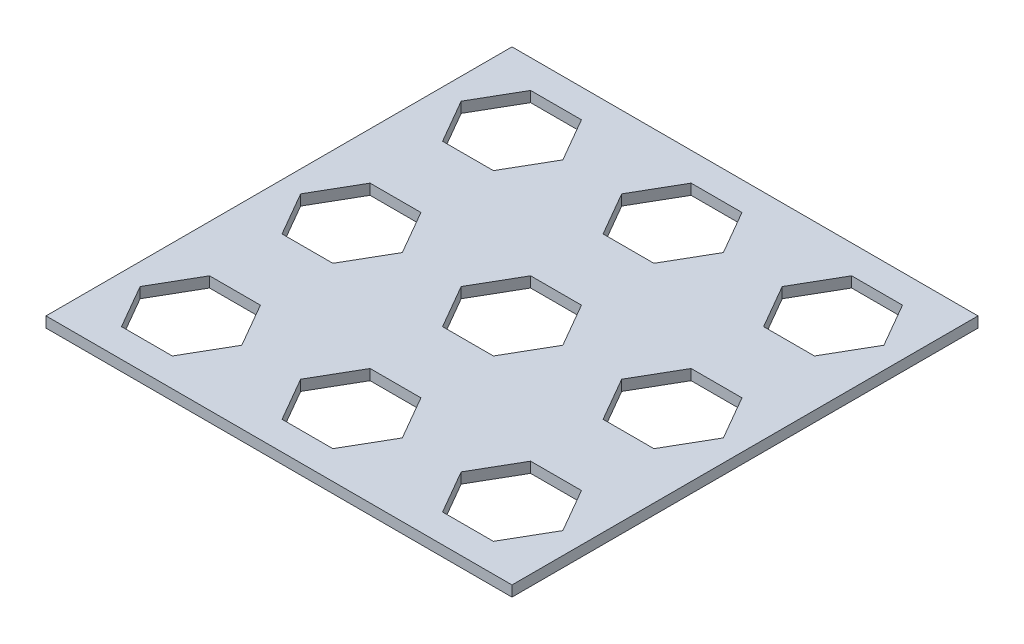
ISO-10303-21;
HEADER;
FILE_DESCRIPTION(('STEP AP214'),'2;1');
FILE_NAME('part.step','',(''),(''),'','','');
FILE_SCHEMA(('AUTOMOTIVE_DESIGN { 1 0 10303 214 1 1 1 1 }'));
ENDSEC;
DATA;
#1=APPLICATION_CONTEXT('core data for automotive mechanical design processes');
#2=APPLICATION_PROTOCOL_DEFINITION('international standard','automotive_design',2000,#1);
#3=PRODUCT_CONTEXT('',#1,'mechanical');
#4=PRODUCT('Part','Part','',(#3));
#5=PRODUCT_RELATED_PRODUCT_CATEGORY('part','',(#4));
#6=PRODUCT_DEFINITION_FORMATION('','',#4);
#7=PRODUCT_DEFINITION_CONTEXT('part definition',#1,'design');
#8=PRODUCT_DEFINITION('design','',#6,#7);
#9=PRODUCT_DEFINITION_SHAPE('','',#8);
#10=(LENGTH_UNIT() NAMED_UNIT(*) SI_UNIT(.MILLI.,.METRE.));
#11=(NAMED_UNIT(*) PLANE_ANGLE_UNIT() SI_UNIT($,.RADIAN.));
#12=(NAMED_UNIT(*) SI_UNIT($,.STERADIAN.) SOLID_ANGLE_UNIT());
#13=UNCERTAINTY_MEASURE_WITH_UNIT(LENGTH_MEASURE(1.E-05),#10,'distance_accuracy_value','');
#14=(GEOMETRIC_REPRESENTATION_CONTEXT(3) GLOBAL_UNCERTAINTY_ASSIGNED_CONTEXT((#13)) GLOBAL_UNIT_ASSIGNED_CONTEXT((#10,
#11,#12)) REPRESENTATION_CONTEXT('',''));
#15=CARTESIAN_POINT('',(0.,0.,0.));
#16=DIRECTION('',(0.,0.,1.));
#17=DIRECTION('',(1.,0.,0.));
#18=AXIS2_PLACEMENT_3D('',#15,#16,#17);
#19=CARTESIAN_POINT('',(0.,1.5875,0.));
#20=DIRECTION('',(0.,-1.,0.));
#21=DIRECTION('',(0.,0.,-1.));
#22=AXIS2_PLACEMENT_3D('',#19,#20,#21);
#23=PLANE('',#22);
#24=DIRECTION('',(0.499999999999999,0.,0.866025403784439));
#25=VECTOR('',#24,1.);
#26=CARTESIAN_POINT('',(-3.81000000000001,1.5875,6.59911357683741));
#27=LINE('',#26,#25);
#28=CARTESIAN_POINT('',(-7.62,1.5875,0.));
#29=VERTEX_POINT('',#28);
#30=CARTESIAN_POINT('',(-3.81000000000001,1.5875,6.59911357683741));
#31=VERTEX_POINT('',#30);
#32=EDGE_CURVE('E453',#29,#31,#27,.T.);
#33=ORIENTED_EDGE('',*,*,#32,.F.);
#34=DIRECTION('',(-0.5,0.,0.866025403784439));
#35=VECTOR('',#34,1.);
#36=CARTESIAN_POINT('',(-7.62,1.5875,0.));
#37=LINE('',#36,#35);
#38=CARTESIAN_POINT('',(-3.81,1.5875,-6.59911357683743));
#39=VERTEX_POINT('',#38);
#40=EDGE_CURVE('E465',#39,#29,#37,.T.);
#41=ORIENTED_EDGE('',*,*,#40,.F.);
#42=DIRECTION('',(-1.,0.,0.));
#43=VECTOR('',#42,1.);
#44=CARTESIAN_POINT('',(-3.81,1.5875,-6.59911357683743));
#45=LINE('',#44,#43);
#46=CARTESIAN_POINT('',(3.81,1.5875,-6.59911357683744));
#47=VERTEX_POINT('',#46);
#48=EDGE_CURVE('E462',#47,#39,#45,.T.);
#49=ORIENTED_EDGE('',*,*,#48,.F.);
#50=DIRECTION('',(-0.499999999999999,0.,-0.866025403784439));
#51=VECTOR('',#50,1.);
#52=CARTESIAN_POINT('',(3.81,1.5875,-6.59911357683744));
#53=LINE('',#52,#51);
#54=CARTESIAN_POINT('',(7.62,1.5875,0.));
#55=VERTEX_POINT('',#54);
#56=EDGE_CURVE('E460',#55,#47,#53,.T.);
#57=ORIENTED_EDGE('',*,*,#56,.F.);
#58=DIRECTION('',(0.5,0.,-0.866025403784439));
#59=VECTOR('',#58,1.);
#60=CARTESIAN_POINT('',(7.62,1.5875,0.));
#61=LINE('',#60,#59);
#62=CARTESIAN_POINT('',(3.81,1.5875,6.59911357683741));
#63=VERTEX_POINT('',#62);
#64=EDGE_CURVE('E458',#63,#55,#61,.T.);
#65=ORIENTED_EDGE('',*,*,#64,.F.);
#66=DIRECTION('',(1.,0.,0.));
#67=VECTOR('',#66,1.);
#68=CARTESIAN_POINT('',(3.81,1.5875,6.59911357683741));
#69=LINE('',#68,#67);
#70=EDGE_CURVE('E455',#31,#63,#69,.T.);
#71=ORIENTED_EDGE('',*,*,#70,.F.);
#72=EDGE_LOOP('',(#33,#41,#49,#57,#65,#71));
#73=FACE_BOUND('',#72,.T.);
#74=DIRECTION('',(-0.5,0.,-0.866025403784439));
#75=VECTOR('',#74,1.);
#76=CARTESIAN_POINT('',(-20.2516135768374,1.5875,17.4625));
#77=LINE('',#76,#75);
#78=CARTESIAN_POINT('',(-16.4416135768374,1.5875,24.0616135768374));
#79=VERTEX_POINT('',#78);
#80=CARTESIAN_POINT('',(-20.2516135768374,1.5875,17.4625));
#81=VERTEX_POINT('',#80);
#82=EDGE_CURVE('E543',#79,#81,#77,.T.);
#83=ORIENTED_EDGE('',*,*,#82,.F.);
#84=DIRECTION('',(0.499999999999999,0.,-0.866025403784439));
#85=VECTOR('',#84,1.);
#86=CARTESIAN_POINT('',(-16.4416135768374,1.5875,24.0616135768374));
#87=LINE('',#86,#85);
#88=CARTESIAN_POINT('',(-20.2516135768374,1.5875,30.6607271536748));
#89=VERTEX_POINT('',#88);
#90=EDGE_CURVE('E555',#89,#79,#87,.T.);
#91=ORIENTED_EDGE('',*,*,#90,.F.);
#92=DIRECTION('',(1.,0.,0.));
#93=VECTOR('',#92,1.);
#94=CARTESIAN_POINT('',(-20.2516135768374,1.5875,30.6607271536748));
#95=LINE('',#94,#93);
#96=CARTESIAN_POINT('',(-27.8716135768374,1.5875,30.6607271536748));
#97=VERTEX_POINT('',#96);
#98=EDGE_CURVE('E552',#97,#89,#95,.T.);
#99=ORIENTED_EDGE('',*,*,#98,.F.);
#100=DIRECTION('',(0.5,0.,0.866025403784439));
#101=VECTOR('',#100,1.);
#102=CARTESIAN_POINT('',(-27.8716135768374,1.5875,30.6607271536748));
#103=LINE('',#102,#101);
#104=CARTESIAN_POINT('',(-31.6816135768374,1.5875,24.0616135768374));
#105=VERTEX_POINT('',#104);
#106=EDGE_CURVE('E550',#105,#97,#103,.T.);
#107=ORIENTED_EDGE('',*,*,#106,.F.);
#108=DIRECTION('',(-0.499999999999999,0.,0.866025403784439));
#109=VECTOR('',#108,1.);
#110=CARTESIAN_POINT('',(-31.6816135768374,1.5875,24.0616135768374));
#111=LINE('',#110,#109);
#112=CARTESIAN_POINT('',(-27.8716135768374,1.5875,17.4625));
#113=VERTEX_POINT('',#112);
#114=EDGE_CURVE('E548',#113,#105,#111,.T.);
#115=ORIENTED_EDGE('',*,*,#114,.F.);
#116=DIRECTION('',(-1.,0.,0.));
#117=VECTOR('',#116,1.);
#118=CARTESIAN_POINT('',(-27.8716135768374,1.5875,17.4625));
#119=LINE('',#118,#117);
#120=EDGE_CURVE('E545',#81,#113,#119,.T.);
#121=ORIENTED_EDGE('',*,*,#120,.F.);
#122=EDGE_LOOP('',(#83,#91,#99,#107,#115,#121));
#123=FACE_BOUND('',#122,.T.);
#124=DIRECTION('',(-1.,0.,0.));
#125=VECTOR('',#124,1.);
#126=CARTESIAN_POINT('',(27.8716135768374,1.5875,17.4625));
#127=LINE('',#126,#125);
#128=CARTESIAN_POINT('',(27.8716135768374,1.5875,17.4625));
#129=VERTEX_POINT('',#128);
#130=CARTESIAN_POINT('',(20.2516135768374,1.5875,17.4625));
#131=VERTEX_POINT('',#130);
#132=EDGE_CURVE('E633',#129,#131,#127,.T.);
#133=ORIENTED_EDGE('',*,*,#132,.F.);
#134=DIRECTION('',(-0.499999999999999,0.,-0.866025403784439));
#135=VECTOR('',#134,1.);
#136=CARTESIAN_POINT('',(31.6816135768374,1.5875,24.0616135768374));
#137=LINE('',#136,#135);
#138=CARTESIAN_POINT('',(31.6816135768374,1.5875,24.0616135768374));
#139=VERTEX_POINT('',#138);
#140=EDGE_CURVE('E645',#139,#129,#137,.T.);
#141=ORIENTED_EDGE('',*,*,#140,.F.);
#142=DIRECTION('',(0.5,0.,-0.866025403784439));
#143=VECTOR('',#142,1.);
#144=CARTESIAN_POINT('',(27.8716135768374,1.5875,30.6607271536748));
#145=LINE('',#144,#143);
#146=CARTESIAN_POINT('',(27.8716135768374,1.5875,30.6607271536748));
#147=VERTEX_POINT('',#146);
#148=EDGE_CURVE('E642',#147,#139,#145,.T.);
#149=ORIENTED_EDGE('',*,*,#148,.F.);
#150=DIRECTION('',(1.,0.,0.));
#151=VECTOR('',#150,1.);
#152=CARTESIAN_POINT('',(20.2516135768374,1.5875,30.6607271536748));
#153=LINE('',#152,#151);
#154=CARTESIAN_POINT('',(20.2516135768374,1.5875,30.6607271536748));
#155=VERTEX_POINT('',#154);
#156=EDGE_CURVE('E640',#155,#147,#153,.T.);
#157=ORIENTED_EDGE('',*,*,#156,.F.);
#158=DIRECTION('',(0.5,0.,0.866025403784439));
#159=VECTOR('',#158,1.);
#160=CARTESIAN_POINT('',(16.4416135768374,1.5875,24.0616135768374));
#161=LINE('',#160,#159);
#162=CARTESIAN_POINT('',(16.4416135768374,1.5875,24.0616135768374));
#163=VERTEX_POINT('',#162);
#164=EDGE_CURVE('E638',#163,#155,#161,.T.);
#165=ORIENTED_EDGE('',*,*,#164,.F.);
#166=DIRECTION('',(-0.500000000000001,0.,0.866025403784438));
#167=VECTOR('',#166,1.);
#168=CARTESIAN_POINT('',(20.2516135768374,1.5875,17.4625));
#169=LINE('',#168,#167);
#170=EDGE_CURVE('E635',#131,#163,#169,.T.);
#171=ORIENTED_EDGE('',*,*,#170,.F.);
#172=EDGE_LOOP('',(#133,#141,#149,#157,#165,#171));
#173=FACE_BOUND('',#172,.T.);
#174=DIRECTION('',(0.5,0.,0.866025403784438));
#175=VECTOR('',#174,1.);
#176=CARTESIAN_POINT('',(20.2516135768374,1.5875,-17.4625));
#177=LINE('',#176,#175);
#178=CARTESIAN_POINT('',(16.4416135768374,1.5875,-24.0616135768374));
#179=VERTEX_POINT('',#178);
#180=CARTESIAN_POINT('',(20.2516135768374,1.5875,-17.4625));
#181=VERTEX_POINT('',#180);
#182=EDGE_CURVE('E723',#179,#181,#177,.T.);
#183=ORIENTED_EDGE('',*,*,#182,.F.);
#184=DIRECTION('',(-0.5,0.,0.866025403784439));
#185=VECTOR('',#184,1.);
#186=CARTESIAN_POINT('',(16.4416135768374,1.5875,-24.0616135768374));
#187=LINE('',#186,#185);
#188=CARTESIAN_POINT('',(20.2516135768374,1.5875,-30.6607271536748));
#189=VERTEX_POINT('',#188);
#190=EDGE_CURVE('E735',#189,#179,#187,.T.);
#191=ORIENTED_EDGE('',*,*,#190,.F.);
#192=DIRECTION('',(-1.,0.,0.));
#193=VECTOR('',#192,1.);
#194=CARTESIAN_POINT('',(20.2516135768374,1.5875,-30.6607271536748));
#195=LINE('',#194,#193);
#196=CARTESIAN_POINT('',(27.8716135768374,1.5875,-30.6607271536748));
#197=VERTEX_POINT('',#196);
#198=EDGE_CURVE('E732',#197,#189,#195,.T.);
#199=ORIENTED_EDGE('',*,*,#198,.F.);
#200=DIRECTION('',(-0.5,0.,-0.866025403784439));
#201=VECTOR('',#200,1.);
#202=CARTESIAN_POINT('',(27.8716135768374,1.5875,-30.6607271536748));
#203=LINE('',#202,#201);
#204=CARTESIAN_POINT('',(31.6816135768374,1.5875,-24.0616135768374));
#205=VERTEX_POINT('',#204);
#206=EDGE_CURVE('E730',#205,#197,#203,.T.);
#207=ORIENTED_EDGE('',*,*,#206,.F.);
#208=DIRECTION('',(0.499999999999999,0.,-0.866025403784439));
#209=VECTOR('',#208,1.);
#210=CARTESIAN_POINT('',(31.6816135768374,1.5875,-24.0616135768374));
#211=LINE('',#210,#209);
#212=CARTESIAN_POINT('',(27.8716135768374,1.5875,-17.4625));
#213=VERTEX_POINT('',#212);
#214=EDGE_CURVE('E728',#213,#205,#211,.T.);
#215=ORIENTED_EDGE('',*,*,#214,.F.);
#216=DIRECTION('',(1.,0.,0.));
#217=VECTOR('',#216,1.);
#218=CARTESIAN_POINT('',(27.8716135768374,1.5875,-17.4625));
#219=LINE('',#218,#217);
#220=EDGE_CURVE('E725',#181,#213,#219,.T.);
#221=ORIENTED_EDGE('',*,*,#220,.F.);
#222=EDGE_LOOP('',(#183,#191,#199,#207,#215,#221));
#223=FACE_BOUND('',#222,.T.);
#224=DIRECTION('',(0.,0.,-1.));
#225=VECTOR('',#224,1.);
#226=CARTESIAN_POINT('',(34.925,1.5875,34.925));
#227=LINE('',#226,#225);
#228=CARTESIAN_POINT('',(34.925,1.5875,34.925));
#229=VERTEX_POINT('',#228);
#230=CARTESIAN_POINT('',(34.925,1.5875,-34.925));
#231=VERTEX_POINT('',#230);
#232=EDGE_CURVE('E813',#229,#231,#227,.T.);
#233=ORIENTED_EDGE('',*,*,#232,.T.);
#234=DIRECTION('',(-1.,0.,0.));
#235=VECTOR('',#234,1.);
#236=CARTESIAN_POINT('',(-34.925,1.5875,-34.925));
#237=LINE('',#236,#235);
#238=CARTESIAN_POINT('',(-34.925,1.5875,-34.925));
#239=VERTEX_POINT('',#238);
#240=EDGE_CURVE('E816',#231,#239,#237,.T.);
#241=ORIENTED_EDGE('',*,*,#240,.T.);
#242=DIRECTION('',(0.,0.,1.));
#243=VECTOR('',#242,1.);
#244=CARTESIAN_POINT('',(-34.925,1.5875,34.925));
#245=LINE('',#244,#243);
#246=CARTESIAN_POINT('',(-34.925,1.5875,34.925));
#247=VERTEX_POINT('',#246);
#248=EDGE_CURVE('E819',#239,#247,#245,.T.);
#249=ORIENTED_EDGE('',*,*,#248,.T.);
#250=DIRECTION('',(1.,0.,0.));
#251=VECTOR('',#250,1.);
#252=CARTESIAN_POINT('',(-34.925,1.5875,34.925));
#253=LINE('',#252,#251);
#254=EDGE_CURVE('E821',#247,#229,#253,.T.);
#255=ORIENTED_EDGE('',*,*,#254,.T.);
#256=EDGE_LOOP('',(#233,#241,#249,#255));
#257=FACE_BOUND('',#256,.T.);
#258=DIRECTION('',(-0.499999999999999,0.,-0.866025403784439));
#259=VECTOR('',#258,1.);
#260=CARTESIAN_POINT('',(-16.4416135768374,1.5875,-24.0616135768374));
#261=LINE('',#260,#259);
#262=CARTESIAN_POINT('',(-16.4416135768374,1.5875,-24.0616135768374));
#263=VERTEX_POINT('',#262);
#264=CARTESIAN_POINT('',(-20.2516135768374,1.5875,-30.6607271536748));
#265=VERTEX_POINT('',#264);
#266=EDGE_CURVE('E768',#263,#265,#261,.T.);
#267=ORIENTED_EDGE('',*,*,#266,.F.);
#268=DIRECTION('',(0.5,0.,-0.866025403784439));
#269=VECTOR('',#268,1.);
#270=CARTESIAN_POINT('',(-20.2516135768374,1.5875,-17.4625));
#271=LINE('',#270,#269);
#272=CARTESIAN_POINT('',(-20.2516135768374,1.5875,-17.4625));
#273=VERTEX_POINT('',#272);
#274=EDGE_CURVE('E780',#273,#263,#271,.T.);
#275=ORIENTED_EDGE('',*,*,#274,.F.);
#276=DIRECTION('',(1.,0.,0.));
#277=VECTOR('',#276,1.);
#278=CARTESIAN_POINT('',(-27.8716135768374,1.5875,-17.4625));
#279=LINE('',#278,#277);
#280=CARTESIAN_POINT('',(-27.8716135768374,1.5875,-17.4625));
#281=VERTEX_POINT('',#280);
#282=EDGE_CURVE('E777',#281,#273,#279,.T.);
#283=ORIENTED_EDGE('',*,*,#282,.F.);
#284=DIRECTION('',(0.499999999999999,0.,0.866025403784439));
#285=VECTOR('',#284,1.);
#286=CARTESIAN_POINT('',(-31.6816135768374,1.5875,-24.0616135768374));
#287=LINE('',#286,#285);
#288=CARTESIAN_POINT('',(-31.6816135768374,1.5875,-24.0616135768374));
#289=VERTEX_POINT('',#288);
#290=EDGE_CURVE('E775',#289,#281,#287,.T.);
#291=ORIENTED_EDGE('',*,*,#290,.F.);
#292=DIRECTION('',(-0.5,0.,0.866025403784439));
#293=VECTOR('',#292,1.);
#294=CARTESIAN_POINT('',(-27.8716135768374,1.5875,-30.6607271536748));
#295=LINE('',#294,#293);
#296=CARTESIAN_POINT('',(-27.8716135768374,1.5875,-30.6607271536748));
#297=VERTEX_POINT('',#296);
#298=EDGE_CURVE('E773',#297,#289,#295,.T.);
#299=ORIENTED_EDGE('',*,*,#298,.F.);
#300=DIRECTION('',(-1.,0.,0.));
#301=VECTOR('',#300,1.);
#302=CARTESIAN_POINT('',(-20.2516135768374,1.5875,-30.6607271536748));
#303=LINE('',#302,#301);
#304=EDGE_CURVE('E770',#265,#297,#303,.T.);
#305=ORIENTED_EDGE('',*,*,#304,.F.);
#306=EDGE_LOOP('',(#267,#275,#283,#291,#299,#305));
#307=FACE_BOUND('',#306,.T.);
#308=DIRECTION('',(0.5,0.,0.866025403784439));
#309=VECTOR('',#308,1.);
#310=CARTESIAN_POINT('',(-7.62,1.5875,-24.0616135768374));
#311=LINE('',#310,#309);
#312=CARTESIAN_POINT('',(-7.62,1.5875,-24.0616135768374));
#313=VERTEX_POINT('',#312);
#314=CARTESIAN_POINT('',(-3.81,1.5875,-17.4625));
#315=VERTEX_POINT('',#314);
#316=EDGE_CURVE('E678',#313,#315,#311,.T.);
#317=ORIENTED_EDGE('',*,*,#316,.F.);
#318=DIRECTION('',(-0.499999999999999,0.,0.866025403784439));
#319=VECTOR('',#318,1.);
#320=CARTESIAN_POINT('',(-3.81000000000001,1.5875,-30.6607271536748));
#321=LINE('',#320,#319);
#322=CARTESIAN_POINT('',(-3.81000000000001,1.5875,-30.6607271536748));
#323=VERTEX_POINT('',#322);
#324=EDGE_CURVE('E690',#323,#313,#321,.T.);
#325=ORIENTED_EDGE('',*,*,#324,.F.);
#326=DIRECTION('',(-1.,0.,0.));
#327=VECTOR('',#326,1.);
#328=CARTESIAN_POINT('',(3.81,1.5875,-30.6607271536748));
#329=LINE('',#328,#327);
#330=CARTESIAN_POINT('',(3.81,1.5875,-30.6607271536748));
#331=VERTEX_POINT('',#330);
#332=EDGE_CURVE('E687',#331,#323,#329,.T.);
#333=ORIENTED_EDGE('',*,*,#332,.F.);
#334=DIRECTION('',(-0.5,0.,-0.866025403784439));
#335=VECTOR('',#334,1.);
#336=CARTESIAN_POINT('',(7.62,1.5875,-24.0616135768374));
#337=LINE('',#336,#335);
#338=CARTESIAN_POINT('',(7.62,1.5875,-24.0616135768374));
#339=VERTEX_POINT('',#338);
#340=EDGE_CURVE('E685',#339,#331,#337,.T.);
#341=ORIENTED_EDGE('',*,*,#340,.F.);
#342=DIRECTION('',(0.499999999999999,0.,-0.866025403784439));
#343=VECTOR('',#342,1.);
#344=CARTESIAN_POINT('',(3.81,1.5875,-17.4625));
#345=LINE('',#344,#343);
#346=CARTESIAN_POINT('',(3.81,1.5875,-17.4625));
#347=VERTEX_POINT('',#346);
#348=EDGE_CURVE('E683',#347,#339,#345,.T.);
#349=ORIENTED_EDGE('',*,*,#348,.F.);
#350=DIRECTION('',(1.,0.,0.));
#351=VECTOR('',#350,1.);
#352=CARTESIAN_POINT('',(-3.81,1.5875,-17.4625));
#353=LINE('',#352,#351);
#354=EDGE_CURVE('E680',#315,#347,#353,.T.);
#355=ORIENTED_EDGE('',*,*,#354,.F.);
#356=EDGE_LOOP('',(#317,#325,#333,#341,#349,#355));
#357=FACE_BOUND('',#356,.T.);
#358=DIRECTION('',(0.499999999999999,0.,0.866025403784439));
#359=VECTOR('',#358,1.);
#360=CARTESIAN_POINT('',(-3.81000000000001,1.5875,30.6607271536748));
#361=LINE('',#360,#359);
#362=CARTESIAN_POINT('',(-7.62,1.5875,24.0616135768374));
#363=VERTEX_POINT('',#362);
#364=CARTESIAN_POINT('',(-3.81000000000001,1.5875,30.6607271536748));
#365=VERTEX_POINT('',#364);
#366=EDGE_CURVE('E588',#363,#365,#361,.T.);
#367=ORIENTED_EDGE('',*,*,#366,.F.);
#368=DIRECTION('',(-0.5,0.,0.866025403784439));
#369=VECTOR('',#368,1.);
#370=CARTESIAN_POINT('',(-7.62,1.5875,24.0616135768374));
#371=LINE('',#370,#369);
#372=CARTESIAN_POINT('',(-3.81,1.5875,17.4625));
#373=VERTEX_POINT('',#372);
#374=EDGE_CURVE('E600',#373,#363,#371,.T.);
#375=ORIENTED_EDGE('',*,*,#374,.F.);
#376=DIRECTION('',(-1.,0.,0.));
#377=VECTOR('',#376,1.);
#378=CARTESIAN_POINT('',(-3.81,1.5875,17.4625));
#379=LINE('',#378,#377);
#380=CARTESIAN_POINT('',(3.81,1.5875,17.4625));
#381=VERTEX_POINT('',#380);
#382=EDGE_CURVE('E597',#381,#373,#379,.T.);
#383=ORIENTED_EDGE('',*,*,#382,.F.);
#384=DIRECTION('',(-0.499999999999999,0.,-0.866025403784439));
#385=VECTOR('',#384,1.);
#386=CARTESIAN_POINT('',(3.81,1.5875,17.4625));
#387=LINE('',#386,#385);
#388=CARTESIAN_POINT('',(7.62,1.5875,24.0616135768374));
#389=VERTEX_POINT('',#388);
#390=EDGE_CURVE('E595',#389,#381,#387,.T.);
#391=ORIENTED_EDGE('',*,*,#390,.F.);
#392=DIRECTION('',(0.5,0.,-0.866025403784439));
#393=VECTOR('',#392,1.);
#394=CARTESIAN_POINT('',(7.62,1.5875,24.0616135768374));
#395=LINE('',#394,#393);
#396=CARTESIAN_POINT('',(3.81,1.5875,30.6607271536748));
#397=VERTEX_POINT('',#396);
#398=EDGE_CURVE('E593',#397,#389,#395,.T.);
#399=ORIENTED_EDGE('',*,*,#398,.F.);
#400=DIRECTION('',(1.,0.,0.));
#401=VECTOR('',#400,1.);
#402=CARTESIAN_POINT('',(3.81,1.5875,30.6607271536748));
#403=LINE('',#402,#401);
#404=EDGE_CURVE('E590',#365,#397,#403,.T.);
#405=ORIENTED_EDGE('',*,*,#404,.F.);
#406=EDGE_LOOP('',(#367,#375,#383,#391,#399,#405));
#407=FACE_BOUND('',#406,.T.);
#408=DIRECTION('',(-1.,0.,0.));
#409=VECTOR('',#408,1.);
#410=CARTESIAN_POINT('',(27.8716135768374,1.5875,-6.59911357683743));
#411=LINE('',#410,#409);
#412=CARTESIAN_POINT('',(27.8716135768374,1.5875,-6.59911357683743));
#413=VERTEX_POINT('',#412);
#414=CARTESIAN_POINT('',(20.2516135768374,1.5875,-6.59911357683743));
#415=VERTEX_POINT('',#414);
#416=EDGE_CURVE('E498',#413,#415,#411,.T.);
#417=ORIENTED_EDGE('',*,*,#416,.F.);
#418=DIRECTION('',(-0.499999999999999,0.,-0.866025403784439));
#419=VECTOR('',#418,1.);
#420=CARTESIAN_POINT('',(31.6816135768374,1.5875,0.));
#421=LINE('',#420,#419);
#422=CARTESIAN_POINT('',(31.6816135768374,1.5875,0.));
#423=VERTEX_POINT('',#422);
#424=EDGE_CURVE('E510',#423,#413,#421,.T.);
#425=ORIENTED_EDGE('',*,*,#424,.F.);
#426=DIRECTION('',(0.500000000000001,0.,-0.866025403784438));
#427=VECTOR('',#426,1.);
#428=CARTESIAN_POINT('',(27.8716135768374,1.5875,6.59911357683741));
#429=LINE('',#428,#427);
#430=CARTESIAN_POINT('',(27.8716135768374,1.5875,6.59911357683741));
#431=VERTEX_POINT('',#430);
#432=EDGE_CURVE('E507',#431,#423,#429,.T.);
#433=ORIENTED_EDGE('',*,*,#432,.F.);
#434=DIRECTION('',(1.,0.,0.));
#435=VECTOR('',#434,1.);
#436=CARTESIAN_POINT('',(20.2516135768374,1.5875,6.59911357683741));
#437=LINE('',#436,#435);
#438=CARTESIAN_POINT('',(20.2516135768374,1.5875,6.59911357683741));
#439=VERTEX_POINT('',#438);
#440=EDGE_CURVE('E505',#439,#431,#437,.T.);
#441=ORIENTED_EDGE('',*,*,#440,.F.);
#442=DIRECTION('',(0.499999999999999,0.,0.866025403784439));
#443=VECTOR('',#442,1.);
#444=CARTESIAN_POINT('',(16.4416135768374,1.5875,0.));
#445=LINE('',#444,#443);
#446=CARTESIAN_POINT('',(16.4416135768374,1.5875,0.));
#447=VERTEX_POINT('',#446);
#448=EDGE_CURVE('E503',#447,#439,#445,.T.);
#449=ORIENTED_EDGE('',*,*,#448,.F.);
#450=DIRECTION('',(-0.500000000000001,0.,0.866025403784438));
#451=VECTOR('',#450,1.);
#452=CARTESIAN_POINT('',(20.2516135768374,1.5875,-6.59911357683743));
#453=LINE('',#452,#451);
#454=EDGE_CURVE('E500',#415,#447,#453,.T.);
#455=ORIENTED_EDGE('',*,*,#454,.F.);
#456=EDGE_LOOP('',(#417,#425,#433,#441,#449,#455));
#457=FACE_BOUND('',#456,.T.);
#458=DIRECTION('',(-0.500000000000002,0.,-0.866025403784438));
#459=VECTOR('',#458,1.);
#460=CARTESIAN_POINT('',(-20.2516135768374,1.5875,-6.59911357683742));
#461=LINE('',#460,#459);
#462=CARTESIAN_POINT('',(-16.4416135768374,1.5875,0.));
#463=VERTEX_POINT('',#462);
#464=CARTESIAN_POINT('',(-20.2516135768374,1.5875,-6.59911357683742));
#465=VERTEX_POINT('',#464);
#466=EDGE_CURVE('E402',#463,#465,#461,.T.);
#467=ORIENTED_EDGE('',*,*,#466,.F.);
#468=DIRECTION('',(0.5,0.,-0.866025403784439));
#469=VECTOR('',#468,1.);
#470=CARTESIAN_POINT('',(-16.4416135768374,1.5875,0.));
#471=LINE('',#470,#469);
#472=CARTESIAN_POINT('',(-20.2516135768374,1.5875,6.59911357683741));
#473=VERTEX_POINT('',#472);
#474=EDGE_CURVE('E431',#473,#463,#471,.T.);
#475=ORIENTED_EDGE('',*,*,#474,.F.);
#476=DIRECTION('',(1.,0.,0.));
#477=VECTOR('',#476,1.);
#478=CARTESIAN_POINT('',(-20.2516135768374,1.5875,6.59911357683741));
#479=LINE('',#478,#477);
#480=CARTESIAN_POINT('',(-27.8716135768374,1.5875,6.59911357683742));
#481=VERTEX_POINT('',#480);
#482=EDGE_CURVE('E429',#481,#473,#479,.T.);
#483=ORIENTED_EDGE('',*,*,#482,.F.);
#484=DIRECTION('',(0.500000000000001,0.,0.866025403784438));
#485=VECTOR('',#484,1.);
#486=CARTESIAN_POINT('',(-27.8716135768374,1.5875,6.59911357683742));
#487=LINE('',#486,#485);
#488=CARTESIAN_POINT('',(-31.6816135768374,1.5875,0.));
#489=VERTEX_POINT('',#488);
#490=EDGE_CURVE('E425',#489,#481,#487,.T.);
#491=ORIENTED_EDGE('',*,*,#490,.F.);
#492=DIRECTION('',(-0.499999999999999,0.,0.866025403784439));
#493=VECTOR('',#492,1.);
#494=CARTESIAN_POINT('',(-31.6816135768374,1.5875,0.));
#495=LINE('',#494,#493);
#496=CARTESIAN_POINT('',(-27.8716135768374,1.5875,-6.59911357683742));
#497=VERTEX_POINT('',#496);
#498=EDGE_CURVE('E423',#497,#489,#495,.T.);
#499=ORIENTED_EDGE('',*,*,#498,.F.);
#500=DIRECTION('',(-1.,0.,0.));
#501=VECTOR('',#500,1.);
#502=CARTESIAN_POINT('',(-27.8716135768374,1.5875,-6.59911357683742));
#503=LINE('',#502,#501);
#504=EDGE_CURVE('E410',#465,#497,#503,.T.);
#505=ORIENTED_EDGE('',*,*,#504,.F.);
#506=EDGE_LOOP('',(#467,#475,#483,#491,#499,#505));
#507=FACE_BOUND('',#506,.T.);
#508=ADVANCED_FACE('F37',(#73,#123,#173,#223,#257,#307,#357,#407,#457,#507),#23,.F.);
#509=CARTESIAN_POINT('',(0.,0.,0.));
#510=DIRECTION('',(0.,-1.,0.));
#511=DIRECTION('',(0.,0.,-1.));
#512=AXIS2_PLACEMENT_3D('',#509,#510,#511);
#513=PLANE('',#512);
#514=DIRECTION('',(0.,0.,-1.));
#515=VECTOR('',#514,1.);
#516=CARTESIAN_POINT('',(34.925,0.,34.925));
#517=LINE('',#516,#515);
#518=CARTESIAN_POINT('',(34.925,0.,34.925));
#519=VERTEX_POINT('',#518);
#520=CARTESIAN_POINT('',(34.925,0.,-34.925));
#521=VERTEX_POINT('',#520);
#522=EDGE_CURVE('E812',#519,#521,#517,.T.);
#523=ORIENTED_EDGE('',*,*,#522,.F.);
#524=DIRECTION('',(1.,0.,0.));
#525=VECTOR('',#524,1.);
#526=CARTESIAN_POINT('',(-34.925,0.,34.925));
#527=LINE('',#526,#525);
#528=CARTESIAN_POINT('',(-34.925,0.,34.925));
#529=VERTEX_POINT('',#528);
#530=EDGE_CURVE('E817',#529,#519,#527,.T.);
#531=ORIENTED_EDGE('',*,*,#530,.F.);
#532=DIRECTION('',(0.,0.,1.));
#533=VECTOR('',#532,1.);
#534=CARTESIAN_POINT('',(-34.925,0.,34.925));
#535=LINE('',#534,#533);
#536=CARTESIAN_POINT('',(-34.925,0.,-34.925));
#537=VERTEX_POINT('',#536);
#538=EDGE_CURVE('E828',#537,#529,#535,.T.);
#539=ORIENTED_EDGE('',*,*,#538,.F.);
#540=DIRECTION('',(-1.,0.,0.));
#541=VECTOR('',#540,1.);
#542=CARTESIAN_POINT('',(-34.925,0.,-34.925));
#543=LINE('',#542,#541);
#544=EDGE_CURVE('E826',#521,#537,#543,.T.);
#545=ORIENTED_EDGE('',*,*,#544,.F.);
#546=EDGE_LOOP('',(#523,#531,#539,#545));
#547=FACE_BOUND('',#546,.T.);
#548=DIRECTION('',(0.5,0.,-0.866025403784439));
#549=VECTOR('',#548,1.);
#550=CARTESIAN_POINT('',(-20.2516135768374,0.,-17.4625));
#551=LINE('',#550,#549);
#552=CARTESIAN_POINT('',(-20.2516135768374,0.,-17.4625));
#553=VERTEX_POINT('',#552);
#554=CARTESIAN_POINT('',(-16.4416135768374,0.,-24.0616135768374));
#555=VERTEX_POINT('',#554);
#556=EDGE_CURVE('E771',#553,#555,#551,.T.);
#557=ORIENTED_EDGE('',*,*,#556,.T.);
#558=DIRECTION('',(-0.499999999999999,0.,-0.866025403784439));
#559=VECTOR('',#558,1.);
#560=CARTESIAN_POINT('',(-16.4416135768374,0.,-24.0616135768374));
#561=LINE('',#560,#559);
#562=CARTESIAN_POINT('',(-20.2516135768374,0.,-30.6607271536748));
#563=VERTEX_POINT('',#562);
#564=EDGE_CURVE('E767',#555,#563,#561,.T.);
#565=ORIENTED_EDGE('',*,*,#564,.T.);
#566=DIRECTION('',(-1.,0.,0.));
#567=VECTOR('',#566,1.);
#568=CARTESIAN_POINT('',(-20.2516135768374,0.,-30.6607271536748));
#569=LINE('',#568,#567);
#570=CARTESIAN_POINT('',(-27.8716135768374,0.,-30.6607271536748));
#571=VERTEX_POINT('',#570);
#572=EDGE_CURVE('E785',#563,#571,#569,.T.);
#573=ORIENTED_EDGE('',*,*,#572,.T.);
#574=DIRECTION('',(-0.5,0.,0.866025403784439));
#575=VECTOR('',#574,1.);
#576=CARTESIAN_POINT('',(-27.8716135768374,0.,-30.6607271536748));
#577=LINE('',#576,#575);
#578=CARTESIAN_POINT('',(-31.6816135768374,0.,-24.0616135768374));
#579=VERTEX_POINT('',#578);
#580=EDGE_CURVE('E788',#571,#579,#577,.T.);
#581=ORIENTED_EDGE('',*,*,#580,.T.);
#582=DIRECTION('',(0.499999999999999,0.,0.866025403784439));
#583=VECTOR('',#582,1.);
#584=CARTESIAN_POINT('',(-31.6816135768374,0.,-24.0616135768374));
#585=LINE('',#584,#583);
#586=CARTESIAN_POINT('',(-27.8716135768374,0.,-17.4625));
#587=VERTEX_POINT('',#586);
#588=EDGE_CURVE('E791',#579,#587,#585,.T.);
#589=ORIENTED_EDGE('',*,*,#588,.T.);
#590=DIRECTION('',(1.,0.,0.));
#591=VECTOR('',#590,1.);
#592=CARTESIAN_POINT('',(-27.8716135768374,0.,-17.4625));
#593=LINE('',#592,#591);
#594=EDGE_CURVE('E794',#587,#553,#593,.T.);
#595=ORIENTED_EDGE('',*,*,#594,.T.);
#596=EDGE_LOOP('',(#557,#565,#573,#581,#589,#595));
#597=FACE_BOUND('',#596,.T.);
#598=DIRECTION('',(-0.5,0.,0.866025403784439));
#599=VECTOR('',#598,1.);
#600=CARTESIAN_POINT('',(16.4416135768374,0.,-24.0616135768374));
#601=LINE('',#600,#599);
#602=CARTESIAN_POINT('',(20.2516135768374,0.,-30.6607271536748));
#603=VERTEX_POINT('',#602);
#604=CARTESIAN_POINT('',(16.4416135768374,0.,-24.0616135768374));
#605=VERTEX_POINT('',#604);
#606=EDGE_CURVE('E726',#603,#605,#601,.T.);
#607=ORIENTED_EDGE('',*,*,#606,.T.);
#608=DIRECTION('',(0.5,0.,0.866025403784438));
#609=VECTOR('',#608,1.);
#610=CARTESIAN_POINT('',(20.2516135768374,0.,-17.4625));
#611=LINE('',#610,#609);
#612=CARTESIAN_POINT('',(20.2516135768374,0.,-17.4625));
#613=VERTEX_POINT('',#612);
#614=EDGE_CURVE('E722',#605,#613,#611,.T.);
#615=ORIENTED_EDGE('',*,*,#614,.T.);
#616=DIRECTION('',(1.,0.,0.));
#617=VECTOR('',#616,1.);
#618=CARTESIAN_POINT('',(27.8716135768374,0.,-17.4625));
#619=LINE('',#618,#617);
#620=CARTESIAN_POINT('',(27.8716135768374,0.,-17.4625));
#621=VERTEX_POINT('',#620);
#622=EDGE_CURVE('E740',#613,#621,#619,.T.);
#623=ORIENTED_EDGE('',*,*,#622,.T.);
#624=DIRECTION('',(0.499999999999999,0.,-0.866025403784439));
#625=VECTOR('',#624,1.);
#626=CARTESIAN_POINT('',(31.6816135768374,0.,-24.0616135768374));
#627=LINE('',#626,#625);
#628=CARTESIAN_POINT('',(31.6816135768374,0.,-24.0616135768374));
#629=VERTEX_POINT('',#628);
#630=EDGE_CURVE('E743',#621,#629,#627,.T.);
#631=ORIENTED_EDGE('',*,*,#630,.T.);
#632=DIRECTION('',(-0.5,0.,-0.866025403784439));
#633=VECTOR('',#632,1.);
#634=CARTESIAN_POINT('',(27.8716135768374,0.,-30.6607271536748));
#635=LINE('',#634,#633);
#636=CARTESIAN_POINT('',(27.8716135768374,0.,-30.6607271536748));
#637=VERTEX_POINT('',#636);
#638=EDGE_CURVE('E746',#629,#637,#635,.T.);
#639=ORIENTED_EDGE('',*,*,#638,.T.);
#640=DIRECTION('',(-1.,0.,0.));
#641=VECTOR('',#640,1.);
#642=CARTESIAN_POINT('',(20.2516135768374,0.,-30.6607271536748));
#643=LINE('',#642,#641);
#644=EDGE_CURVE('E749',#637,#603,#643,.T.);
#645=ORIENTED_EDGE('',*,*,#644,.T.);
#646=EDGE_LOOP('',(#607,#615,#623,#631,#639,#645));
#647=FACE_BOUND('',#646,.T.);
#648=DIRECTION('',(-0.499999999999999,0.,0.866025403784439));
#649=VECTOR('',#648,1.);
#650=CARTESIAN_POINT('',(-3.81000000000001,0.,-30.6607271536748));
#651=LINE('',#650,#649);
#652=CARTESIAN_POINT('',(-3.81000000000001,0.,-30.6607271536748));
#653=VERTEX_POINT('',#652);
#654=CARTESIAN_POINT('',(-7.62,0.,-24.0616135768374));
#655=VERTEX_POINT('',#654);
#656=EDGE_CURVE('E681',#653,#655,#651,.T.);
#657=ORIENTED_EDGE('',*,*,#656,.T.);
#658=DIRECTION('',(0.5,0.,0.866025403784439));
#659=VECTOR('',#658,1.);
#660=CARTESIAN_POINT('',(-7.62,0.,-24.0616135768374));
#661=LINE('',#660,#659);
#662=CARTESIAN_POINT('',(-3.81,0.,-17.4625));
#663=VERTEX_POINT('',#662);
#664=EDGE_CURVE('E677',#655,#663,#661,.T.);
#665=ORIENTED_EDGE('',*,*,#664,.T.);
#666=DIRECTION('',(1.,0.,0.));
#667=VECTOR('',#666,1.);
#668=CARTESIAN_POINT('',(-3.81,0.,-17.4625));
#669=LINE('',#668,#667);
#670=CARTESIAN_POINT('',(3.81,0.,-17.4625));
#671=VERTEX_POINT('',#670);
#672=EDGE_CURVE('E695',#663,#671,#669,.T.);
#673=ORIENTED_EDGE('',*,*,#672,.T.);
#674=DIRECTION('',(0.499999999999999,0.,-0.866025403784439));
#675=VECTOR('',#674,1.);
#676=CARTESIAN_POINT('',(3.81,0.,-17.4625));
#677=LINE('',#676,#675);
#678=CARTESIAN_POINT('',(7.62,0.,-24.0616135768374));
#679=VERTEX_POINT('',#678);
#680=EDGE_CURVE('E698',#671,#679,#677,.T.);
#681=ORIENTED_EDGE('',*,*,#680,.T.);
#682=DIRECTION('',(-0.5,0.,-0.866025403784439));
#683=VECTOR('',#682,1.);
#684=CARTESIAN_POINT('',(7.62,0.,-24.0616135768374));
#685=LINE('',#684,#683);
#686=CARTESIAN_POINT('',(3.81,0.,-30.6607271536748));
#687=VERTEX_POINT('',#686);
#688=EDGE_CURVE('E701',#679,#687,#685,.T.);
#689=ORIENTED_EDGE('',*,*,#688,.T.);
#690=DIRECTION('',(-1.,0.,0.));
#691=VECTOR('',#690,1.);
#692=CARTESIAN_POINT('',(3.81,0.,-30.6607271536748));
#693=LINE('',#692,#691);
#694=EDGE_CURVE('E704',#687,#653,#693,.T.);
#695=ORIENTED_EDGE('',*,*,#694,.T.);
#696=EDGE_LOOP('',(#657,#665,#673,#681,#689,#695));
#697=FACE_BOUND('',#696,.T.);
#698=DIRECTION('',(-0.499999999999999,0.,-0.866025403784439));
#699=VECTOR('',#698,1.);
#700=CARTESIAN_POINT('',(31.6816135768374,0.,24.0616135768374));
#701=LINE('',#700,#699);
#702=CARTESIAN_POINT('',(31.6816135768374,0.,24.0616135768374));
#703=VERTEX_POINT('',#702);
#704=CARTESIAN_POINT('',(27.8716135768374,0.,17.4625));
#705=VERTEX_POINT('',#704);
#706=EDGE_CURVE('E636',#703,#705,#701,.T.);
#707=ORIENTED_EDGE('',*,*,#706,.T.);
#708=DIRECTION('',(-1.,0.,0.));
#709=VECTOR('',#708,1.);
#710=CARTESIAN_POINT('',(27.8716135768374,0.,17.4625));
#711=LINE('',#710,#709);
#712=CARTESIAN_POINT('',(20.2516135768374,0.,17.4625));
#713=VERTEX_POINT('',#712);
#714=EDGE_CURVE('E632',#705,#713,#711,.T.);
#715=ORIENTED_EDGE('',*,*,#714,.T.);
#716=DIRECTION('',(-0.500000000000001,0.,0.866025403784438));
#717=VECTOR('',#716,1.);
#718=CARTESIAN_POINT('',(20.2516135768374,0.,17.4625));
#719=LINE('',#718,#717);
#720=CARTESIAN_POINT('',(16.4416135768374,0.,24.0616135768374));
#721=VERTEX_POINT('',#720);
#722=EDGE_CURVE('E650',#713,#721,#719,.T.);
#723=ORIENTED_EDGE('',*,*,#722,.T.);
#724=DIRECTION('',(0.5,0.,0.866025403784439));
#725=VECTOR('',#724,1.);
#726=CARTESIAN_POINT('',(16.4416135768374,0.,24.0616135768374));
#727=LINE('',#726,#725);
#728=CARTESIAN_POINT('',(20.2516135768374,0.,30.6607271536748));
#729=VERTEX_POINT('',#728);
#730=EDGE_CURVE('E653',#721,#729,#727,.T.);
#731=ORIENTED_EDGE('',*,*,#730,.T.);
#732=DIRECTION('',(1.,0.,0.));
#733=VECTOR('',#732,1.);
#734=CARTESIAN_POINT('',(20.2516135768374,0.,30.6607271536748));
#735=LINE('',#734,#733);
#736=CARTESIAN_POINT('',(27.8716135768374,0.,30.6607271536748));
#737=VERTEX_POINT('',#736);
#738=EDGE_CURVE('E656',#729,#737,#735,.T.);
#739=ORIENTED_EDGE('',*,*,#738,.T.);
#740=DIRECTION('',(0.5,0.,-0.866025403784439));
#741=VECTOR('',#740,1.);
#742=CARTESIAN_POINT('',(27.8716135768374,0.,30.6607271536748));
#743=LINE('',#742,#741);
#744=EDGE_CURVE('E659',#737,#703,#743,.T.);
#745=ORIENTED_EDGE('',*,*,#744,.T.);
#746=EDGE_LOOP('',(#707,#715,#723,#731,#739,#745));
#747=FACE_BOUND('',#746,.T.);
#748=DIRECTION('',(-0.5,0.,0.866025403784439));
#749=VECTOR('',#748,1.);
#750=CARTESIAN_POINT('',(-7.62,0.,24.0616135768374));
#751=LINE('',#750,#749);
#752=CARTESIAN_POINT('',(-3.81,0.,17.4625));
#753=VERTEX_POINT('',#752);
#754=CARTESIAN_POINT('',(-7.62,0.,24.0616135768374));
#755=VERTEX_POINT('',#754);
#756=EDGE_CURVE('E591',#753,#755,#751,.T.);
#757=ORIENTED_EDGE('',*,*,#756,.T.);
#758=DIRECTION('',(0.499999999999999,0.,0.866025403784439));
#759=VECTOR('',#758,1.);
#760=CARTESIAN_POINT('',(-3.81000000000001,0.,30.6607271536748));
#761=LINE('',#760,#759);
#762=CARTESIAN_POINT('',(-3.81000000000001,0.,30.6607271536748));
#763=VERTEX_POINT('',#762);
#764=EDGE_CURVE('E587',#755,#763,#761,.T.);
#765=ORIENTED_EDGE('',*,*,#764,.T.);
#766=DIRECTION('',(1.,0.,0.));
#767=VECTOR('',#766,1.);
#768=CARTESIAN_POINT('',(3.81,0.,30.6607271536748));
#769=LINE('',#768,#767);
#770=CARTESIAN_POINT('',(3.81,0.,30.6607271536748));
#771=VERTEX_POINT('',#770);
#772=EDGE_CURVE('E605',#763,#771,#769,.T.);
#773=ORIENTED_EDGE('',*,*,#772,.T.);
#774=DIRECTION('',(0.5,0.,-0.866025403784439));
#775=VECTOR('',#774,1.);
#776=CARTESIAN_POINT('',(7.62,0.,24.0616135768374));
#777=LINE('',#776,#775);
#778=CARTESIAN_POINT('',(7.62,0.,24.0616135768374));
#779=VERTEX_POINT('',#778);
#780=EDGE_CURVE('E608',#771,#779,#777,.T.);
#781=ORIENTED_EDGE('',*,*,#780,.T.);
#782=DIRECTION('',(-0.499999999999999,0.,-0.866025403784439));
#783=VECTOR('',#782,1.);
#784=CARTESIAN_POINT('',(3.81,0.,17.4625));
#785=LINE('',#784,#783);
#786=CARTESIAN_POINT('',(3.81,0.,17.4625));
#787=VERTEX_POINT('',#786);
#788=EDGE_CURVE('E611',#779,#787,#785,.T.);
#789=ORIENTED_EDGE('',*,*,#788,.T.);
#790=DIRECTION('',(-1.,0.,0.));
#791=VECTOR('',#790,1.);
#792=CARTESIAN_POINT('',(-3.81,0.,17.4625));
#793=LINE('',#792,#791);
#794=EDGE_CURVE('E614',#787,#753,#793,.T.);
#795=ORIENTED_EDGE('',*,*,#794,.T.);
#796=EDGE_LOOP('',(#757,#765,#773,#781,#789,#795));
#797=FACE_BOUND('',#796,.T.);
#798=DIRECTION('',(0.499999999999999,0.,-0.866025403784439));
#799=VECTOR('',#798,1.);
#800=CARTESIAN_POINT('',(-16.4416135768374,0.,24.0616135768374));
#801=LINE('',#800,#799);
#802=CARTESIAN_POINT('',(-20.2516135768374,0.,30.6607271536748));
#803=VERTEX_POINT('',#802);
#804=CARTESIAN_POINT('',(-16.4416135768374,0.,24.0616135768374));
#805=VERTEX_POINT('',#804);
#806=EDGE_CURVE('E546',#803,#805,#801,.T.);
#807=ORIENTED_EDGE('',*,*,#806,.T.);
#808=DIRECTION('',(-0.5,0.,-0.866025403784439));
#809=VECTOR('',#808,1.);
#810=CARTESIAN_POINT('',(-20.2516135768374,0.,17.4625));
#811=LINE('',#810,#809);
#812=CARTESIAN_POINT('',(-20.2516135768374,0.,17.4625));
#813=VERTEX_POINT('',#812);
#814=EDGE_CURVE('E542',#805,#813,#811,.T.);
#815=ORIENTED_EDGE('',*,*,#814,.T.);
#816=DIRECTION('',(-1.,0.,0.));
#817=VECTOR('',#816,1.);
#818=CARTESIAN_POINT('',(-27.8716135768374,0.,17.4625));
#819=LINE('',#818,#817);
#820=CARTESIAN_POINT('',(-27.8716135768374,0.,17.4625));
#821=VERTEX_POINT('',#820);
#822=EDGE_CURVE('E560',#813,#821,#819,.T.);
#823=ORIENTED_EDGE('',*,*,#822,.T.);
#824=DIRECTION('',(-0.499999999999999,0.,0.866025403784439));
#825=VECTOR('',#824,1.);
#826=CARTESIAN_POINT('',(-31.6816135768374,0.,24.0616135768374));
#827=LINE('',#826,#825);
#828=CARTESIAN_POINT('',(-31.6816135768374,0.,24.0616135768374));
#829=VERTEX_POINT('',#828);
#830=EDGE_CURVE('E563',#821,#829,#827,.T.);
#831=ORIENTED_EDGE('',*,*,#830,.T.);
#832=DIRECTION('',(0.5,0.,0.866025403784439));
#833=VECTOR('',#832,1.);
#834=CARTESIAN_POINT('',(-27.8716135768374,0.,30.6607271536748));
#835=LINE('',#834,#833);
#836=CARTESIAN_POINT('',(-27.8716135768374,0.,30.6607271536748));
#837=VERTEX_POINT('',#836);
#838=EDGE_CURVE('E566',#829,#837,#835,.T.);
#839=ORIENTED_EDGE('',*,*,#838,.T.);
#840=DIRECTION('',(1.,0.,0.));
#841=VECTOR('',#840,1.);
#842=CARTESIAN_POINT('',(-20.2516135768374,0.,30.6607271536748));
#843=LINE('',#842,#841);
#844=EDGE_CURVE('E569',#837,#803,#843,.T.);
#845=ORIENTED_EDGE('',*,*,#844,.T.);
#846=EDGE_LOOP('',(#807,#815,#823,#831,#839,#845));
#847=FACE_BOUND('',#846,.T.);
#848=DIRECTION('',(-0.499999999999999,0.,-0.866025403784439));
#849=VECTOR('',#848,1.);
#850=CARTESIAN_POINT('',(31.6816135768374,0.,0.));
#851=LINE('',#850,#849);
#852=CARTESIAN_POINT('',(31.6816135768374,0.,0.));
#853=VERTEX_POINT('',#852);
#854=CARTESIAN_POINT('',(27.8716135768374,0.,-6.59911357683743));
#855=VERTEX_POINT('',#854);
#856=EDGE_CURVE('E501',#853,#855,#851,.T.);
#857=ORIENTED_EDGE('',*,*,#856,.T.);
#858=DIRECTION('',(-1.,0.,0.));
#859=VECTOR('',#858,1.);
#860=CARTESIAN_POINT('',(27.8716135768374,0.,-6.59911357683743));
#861=LINE('',#860,#859);
#862=CARTESIAN_POINT('',(20.2516135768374,0.,-6.59911357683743));
#863=VERTEX_POINT('',#862);
#864=EDGE_CURVE('E497',#855,#863,#861,.T.);
#865=ORIENTED_EDGE('',*,*,#864,.T.);
#866=DIRECTION('',(-0.500000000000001,0.,0.866025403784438));
#867=VECTOR('',#866,1.);
#868=CARTESIAN_POINT('',(20.2516135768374,0.,-6.59911357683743));
#869=LINE('',#868,#867);
#870=CARTESIAN_POINT('',(16.4416135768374,0.,0.));
#871=VERTEX_POINT('',#870);
#872=EDGE_CURVE('E515',#863,#871,#869,.T.);
#873=ORIENTED_EDGE('',*,*,#872,.T.);
#874=DIRECTION('',(0.499999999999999,0.,0.866025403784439));
#875=VECTOR('',#874,1.);
#876=CARTESIAN_POINT('',(16.4416135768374,0.,0.));
#877=LINE('',#876,#875);
#878=CARTESIAN_POINT('',(20.2516135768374,0.,6.59911357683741));
#879=VERTEX_POINT('',#878);
#880=EDGE_CURVE('E518',#871,#879,#877,.T.);
#881=ORIENTED_EDGE('',*,*,#880,.T.);
#882=DIRECTION('',(1.,0.,0.));
#883=VECTOR('',#882,1.);
#884=CARTESIAN_POINT('',(20.2516135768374,0.,6.59911357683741));
#885=LINE('',#884,#883);
#886=CARTESIAN_POINT('',(27.8716135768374,0.,6.59911357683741));
#887=VERTEX_POINT('',#886);
#888=EDGE_CURVE('E521',#879,#887,#885,.T.);
#889=ORIENTED_EDGE('',*,*,#888,.T.);
#890=DIRECTION('',(0.500000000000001,0.,-0.866025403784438));
#891=VECTOR('',#890,1.);
#892=CARTESIAN_POINT('',(27.8716135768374,0.,6.59911357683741));
#893=LINE('',#892,#891);
#894=EDGE_CURVE('E524',#887,#853,#893,.T.);
#895=ORIENTED_EDGE('',*,*,#894,.T.);
#896=EDGE_LOOP('',(#857,#865,#873,#881,#889,#895));
#897=FACE_BOUND('',#896,.T.);
#898=DIRECTION('',(-0.5,0.,0.866025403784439));
#899=VECTOR('',#898,1.);
#900=CARTESIAN_POINT('',(-7.62,0.,0.));
#901=LINE('',#900,#899);
#902=CARTESIAN_POINT('',(-3.81,0.,-6.59911357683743));
#903=VERTEX_POINT('',#902);
#904=CARTESIAN_POINT('',(-7.62,0.,0.));
#905=VERTEX_POINT('',#904);
#906=EDGE_CURVE('E456',#903,#905,#901,.T.);
#907=ORIENTED_EDGE('',*,*,#906,.T.);
#908=DIRECTION('',(0.499999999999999,0.,0.866025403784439));
#909=VECTOR('',#908,1.);
#910=CARTESIAN_POINT('',(-3.81000000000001,0.,6.59911357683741));
#911=LINE('',#910,#909);
#912=CARTESIAN_POINT('',(-3.81000000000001,0.,6.59911357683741));
#913=VERTEX_POINT('',#912);
#914=EDGE_CURVE('E418',#905,#913,#911,.T.);
#915=ORIENTED_EDGE('',*,*,#914,.T.);
#916=DIRECTION('',(1.,0.,0.));
#917=VECTOR('',#916,1.);
#918=CARTESIAN_POINT('',(3.81,0.,6.59911357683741));
#919=LINE('',#918,#917);
#920=CARTESIAN_POINT('',(3.81,0.,6.59911357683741));
#921=VERTEX_POINT('',#920);
#922=EDGE_CURVE('E470',#913,#921,#919,.T.);
#923=ORIENTED_EDGE('',*,*,#922,.T.);
#924=DIRECTION('',(0.5,0.,-0.866025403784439));
#925=VECTOR('',#924,1.);
#926=CARTESIAN_POINT('',(7.62,0.,0.));
#927=LINE('',#926,#925);
#928=CARTESIAN_POINT('',(7.62,0.,0.));
#929=VERTEX_POINT('',#928);
#930=EDGE_CURVE('E473',#921,#929,#927,.T.);
#931=ORIENTED_EDGE('',*,*,#930,.T.);
#932=DIRECTION('',(-0.499999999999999,0.,-0.866025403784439));
#933=VECTOR('',#932,1.);
#934=CARTESIAN_POINT('',(3.81,0.,-6.59911357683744));
#935=LINE('',#934,#933);
#936=CARTESIAN_POINT('',(3.81,0.,-6.59911357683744));
#937=VERTEX_POINT('',#936);
#938=EDGE_CURVE('E476',#929,#937,#935,.T.);
#939=ORIENTED_EDGE('',*,*,#938,.T.);
#940=DIRECTION('',(-1.,0.,0.));
#941=VECTOR('',#940,1.);
#942=CARTESIAN_POINT('',(-3.81,0.,-6.59911357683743));
#943=LINE('',#942,#941);
#944=EDGE_CURVE('E479',#937,#903,#943,.T.);
#945=ORIENTED_EDGE('',*,*,#944,.T.);
#946=EDGE_LOOP('',(#907,#915,#923,#931,#939,#945));
#947=FACE_BOUND('',#946,.T.);
#948=DIRECTION('',(0.5,0.,-0.866025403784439));
#949=VECTOR('',#948,1.);
#950=CARTESIAN_POINT('',(-16.4416135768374,0.,0.));
#951=LINE('',#950,#949);
#952=CARTESIAN_POINT('',(-20.2516135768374,0.,6.59911357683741));
#953=VERTEX_POINT('',#952);
#954=CARTESIAN_POINT('',(-16.4416135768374,0.,0.));
#955=VERTEX_POINT('',#954);
#956=EDGE_CURVE('E411',#953,#955,#951,.T.);
#957=ORIENTED_EDGE('',*,*,#956,.T.);
#958=DIRECTION('',(-0.500000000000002,0.,-0.866025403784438));
#959=VECTOR('',#958,1.);
#960=CARTESIAN_POINT('',(-20.2516135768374,0.,-6.59911357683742));
#961=LINE('',#960,#959);
#962=CARTESIAN_POINT('',(-20.2516135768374,0.,-6.59911357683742));
#963=VERTEX_POINT('',#962);
#964=EDGE_CURVE('E60',#955,#963,#961,.T.);
#965=ORIENTED_EDGE('',*,*,#964,.T.);
#966=DIRECTION('',(-1.,0.,0.));
#967=VECTOR('',#966,1.);
#968=CARTESIAN_POINT('',(-27.8716135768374,0.,-6.59911357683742));
#969=LINE('',#968,#967);
#970=CARTESIAN_POINT('',(-27.8716135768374,0.,-6.59911357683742));
#971=VERTEX_POINT('',#970);
#972=EDGE_CURVE('E417',#963,#971,#969,.T.);
#973=ORIENTED_EDGE('',*,*,#972,.T.);
#974=DIRECTION('',(-0.499999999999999,0.,0.866025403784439));
#975=VECTOR('',#974,1.);
#976=CARTESIAN_POINT('',(-31.6816135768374,0.,0.));
#977=LINE('',#976,#975);
#978=CARTESIAN_POINT('',(-31.6816135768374,0.,0.));
#979=VERTEX_POINT('',#978);
#980=EDGE_CURVE('E435',#971,#979,#977,.T.);
#981=ORIENTED_EDGE('',*,*,#980,.T.);
#982=DIRECTION('',(0.500000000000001,0.,0.866025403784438));
#983=VECTOR('',#982,1.);
#984=CARTESIAN_POINT('',(-27.8716135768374,0.,6.59911357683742));
#985=LINE('',#984,#983);
#986=CARTESIAN_POINT('',(-27.8716135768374,0.,6.59911357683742));
#987=VERTEX_POINT('',#986);
#988=EDGE_CURVE('E438',#979,#987,#985,.T.);
#989=ORIENTED_EDGE('',*,*,#988,.T.);
#990=DIRECTION('',(1.,0.,0.));
#991=VECTOR('',#990,1.);
#992=CARTESIAN_POINT('',(-20.2516135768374,0.,6.59911357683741));
#993=LINE('',#992,#991);
#994=EDGE_CURVE('E441',#987,#953,#993,.T.);
#995=ORIENTED_EDGE('',*,*,#994,.T.);
#996=EDGE_LOOP('',(#957,#965,#973,#981,#989,#995));
#997=FACE_BOUND('',#996,.T.);
#998=ADVANCED_FACE('F846',(#547,#597,#647,#697,#747,#797,#847,#897,#947,#997),#513,.T.);
#999=CARTESIAN_POINT('',(34.925,1.5875,34.925));
#1000=DIRECTION('',(-1.,0.,0.));
#1001=DIRECTION('',(0.,0.,1.));
#1002=AXIS2_PLACEMENT_3D('',#999,#1000,#1001);
#1003=PLANE('',#1002);
#1004=ORIENTED_EDGE('',*,*,#522,.T.);
#1005=DIRECTION('',(0.,-1.,0.));
#1006=VECTOR('',#1005,1.);
#1007=CARTESIAN_POINT('',(34.925,1.5875,-34.925));
#1008=LINE('',#1007,#1006);
#1009=EDGE_CURVE('E11',#231,#521,#1008,.T.);
#1010=ORIENTED_EDGE('',*,*,#1009,.F.);
#1011=ORIENTED_EDGE('',*,*,#232,.F.);
#1012=DIRECTION('',(0.,-1.,0.));
#1013=VECTOR('',#1012,1.);
#1014=CARTESIAN_POINT('',(34.925,1.5875,34.925));
#1015=LINE('',#1014,#1013);
#1016=EDGE_CURVE('E823',#229,#519,#1015,.T.);
#1017=ORIENTED_EDGE('',*,*,#1016,.T.);
#1018=EDGE_LOOP('',(#1004,#1010,#1011,#1017));
#1019=FACE_BOUND('',#1018,.T.);
#1020=ADVANCED_FACE('F39',(#1019),#1003,.F.);
#1021=CARTESIAN_POINT('',(-34.925,1.5875,-34.925));
#1022=DIRECTION('',(0.,0.,1.));
#1023=DIRECTION('',(1.,0.,0.));
#1024=AXIS2_PLACEMENT_3D('',#1021,#1022,#1023);
#1025=PLANE('',#1024);
#1026=ORIENTED_EDGE('',*,*,#544,.T.);
#1027=DIRECTION('',(0.,-1.,0.));
#1028=VECTOR('',#1027,1.);
#1029=CARTESIAN_POINT('',(-34.925,1.5875,-34.925));
#1030=LINE('',#1029,#1028);
#1031=EDGE_CURVE('E45',#239,#537,#1030,.T.);
#1032=ORIENTED_EDGE('',*,*,#1031,.F.);
#1033=ORIENTED_EDGE('',*,*,#240,.F.);
#1034=ORIENTED_EDGE('',*,*,#1009,.T.);
#1035=EDGE_LOOP('',(#1026,#1032,#1033,#1034));
#1036=FACE_BOUND('',#1035,.T.);
#1037=ADVANCED_FACE('F857',(#1036),#1025,.F.);
#1038=CARTESIAN_POINT('',(-34.925,1.5875,34.925));
#1039=DIRECTION('',(1.,0.,0.));
#1040=DIRECTION('',(0.,0.,-1.));
#1041=AXIS2_PLACEMENT_3D('',#1038,#1039,#1040);
#1042=PLANE('',#1041);
#1043=ORIENTED_EDGE('',*,*,#538,.T.);
#1044=DIRECTION('',(0.,-1.,0.));
#1045=VECTOR('',#1044,1.);
#1046=CARTESIAN_POINT('',(-34.925,1.5875,34.925));
#1047=LINE('',#1046,#1045);
#1048=EDGE_CURVE('E833',#247,#529,#1047,.T.);
#1049=ORIENTED_EDGE('',*,*,#1048,.F.);
#1050=ORIENTED_EDGE('',*,*,#248,.F.);
#1051=ORIENTED_EDGE('',*,*,#1031,.T.);
#1052=EDGE_LOOP('',(#1043,#1049,#1050,#1051));
#1053=FACE_BOUND('',#1052,.T.);
#1054=ADVANCED_FACE('F840',(#1053),#1042,.F.);
#1055=CARTESIAN_POINT('',(-34.925,1.5875,34.925));
#1056=DIRECTION('',(0.,0.,-1.));
#1057=DIRECTION('',(-1.,0.,0.));
#1058=AXIS2_PLACEMENT_3D('',#1055,#1056,#1057);
#1059=PLANE('',#1058);
#1060=ORIENTED_EDGE('',*,*,#530,.T.);
#1061=ORIENTED_EDGE('',*,*,#1016,.F.);
#1062=ORIENTED_EDGE('',*,*,#254,.F.);
#1063=ORIENTED_EDGE('',*,*,#1048,.T.);
#1064=EDGE_LOOP('',(#1060,#1061,#1062,#1063));
#1065=FACE_BOUND('',#1064,.T.);
#1066=ADVANCED_FACE('F850',(#1065),#1059,.F.);
#1067=CARTESIAN_POINT('',(-16.4416135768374,1.5875,-24.0616135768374));
#1068=DIRECTION('',(-0.866025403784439,0.,0.499999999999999));
#1069=DIRECTION('',(0.5,0.,0.866025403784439));
#1070=AXIS2_PLACEMENT_3D('',#1067,#1068,#1069);
#1071=PLANE('',#1070);
#1072=ORIENTED_EDGE('',*,*,#564,.F.);
#1073=DIRECTION('',(0.,-1.,0.));
#1074=VECTOR('',#1073,1.);
#1075=CARTESIAN_POINT('',(-16.4416135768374,1.5875,-24.0616135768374));
#1076=LINE('',#1075,#1074);
#1077=EDGE_CURVE('E782',#263,#555,#1076,.T.);
#1078=ORIENTED_EDGE('',*,*,#1077,.F.);
#1079=ORIENTED_EDGE('',*,*,#266,.T.);
#1080=DIRECTION('',(0.,-1.,0.));
#1081=VECTOR('',#1080,1.);
#1082=CARTESIAN_POINT('',(-20.2516135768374,1.5875,-30.6607271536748));
#1083=LINE('',#1082,#1081);
#1084=EDGE_CURVE('E809',#265,#563,#1083,.T.);
#1085=ORIENTED_EDGE('',*,*,#1084,.T.);
#1086=EDGE_LOOP('',(#1072,#1078,#1079,#1085));
#1087=FACE_BOUND('',#1086,.T.);
#1088=ADVANCED_FACE('F874',(#1087),#1071,.T.);
#1089=CARTESIAN_POINT('',(-20.2516135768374,1.5875,-30.6607271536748));
#1090=DIRECTION('',(0.,0.,1.));
#1091=DIRECTION('',(1.,0.,0.));
#1092=AXIS2_PLACEMENT_3D('',#1089,#1090,#1091);
#1093=PLANE('',#1092);
#1094=ORIENTED_EDGE('',*,*,#572,.F.);
#1095=ORIENTED_EDGE('',*,*,#1084,.F.);
#1096=ORIENTED_EDGE('',*,*,#304,.T.);
#1097=DIRECTION('',(0.,-1.,0.));
#1098=VECTOR('',#1097,1.);
#1099=CARTESIAN_POINT('',(-27.8716135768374,1.5875,-30.6607271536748));
#1100=LINE('',#1099,#1098);
#1101=EDGE_CURVE('E807',#297,#571,#1100,.T.);
#1102=ORIENTED_EDGE('',*,*,#1101,.T.);
#1103=EDGE_LOOP('',(#1094,#1095,#1096,#1102));
#1104=FACE_BOUND('',#1103,.T.);
#1105=ADVANCED_FACE('F881',(#1104),#1093,.T.);
#1106=CARTESIAN_POINT('',(-27.8716135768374,1.5875,-30.6607271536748));
#1107=DIRECTION('',(0.866025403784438,0.,0.5));
#1108=DIRECTION('',(0.5,0.,-0.866025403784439));
#1109=AXIS2_PLACEMENT_3D('',#1106,#1107,#1108);
#1110=PLANE('',#1109);
#1111=ORIENTED_EDGE('',*,*,#580,.F.);
#1112=ORIENTED_EDGE('',*,*,#1101,.F.);
#1113=ORIENTED_EDGE('',*,*,#298,.T.);
#1114=DIRECTION('',(0.,-1.,0.));
#1115=VECTOR('',#1114,1.);
#1116=CARTESIAN_POINT('',(-31.6816135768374,1.5875,-24.0616135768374));
#1117=LINE('',#1116,#1115);
#1118=EDGE_CURVE('E805',#289,#579,#1117,.T.);
#1119=ORIENTED_EDGE('',*,*,#1118,.T.);
#1120=EDGE_LOOP('',(#1111,#1112,#1113,#1119));
#1121=FACE_BOUND('',#1120,.T.);
#1122=ADVANCED_FACE('F886',(#1121),#1110,.T.);
#1123=CARTESIAN_POINT('',(-31.6816135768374,1.5875,-24.0616135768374));
#1124=DIRECTION('',(0.866025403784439,0.,-0.499999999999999));
#1125=DIRECTION('',(-0.499999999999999,0.,-0.866025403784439));
#1126=AXIS2_PLACEMENT_3D('',#1123,#1124,#1125);
#1127=PLANE('',#1126);
#1128=ORIENTED_EDGE('',*,*,#588,.F.);
#1129=ORIENTED_EDGE('',*,*,#1118,.F.);
#1130=ORIENTED_EDGE('',*,*,#290,.T.);
#1131=DIRECTION('',(0.,-1.,0.));
#1132=VECTOR('',#1131,1.);
#1133=CARTESIAN_POINT('',(-27.8716135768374,1.5875,-17.4625));
#1134=LINE('',#1133,#1132);
#1135=EDGE_CURVE('E803',#281,#587,#1134,.T.);
#1136=ORIENTED_EDGE('',*,*,#1135,.T.);
#1137=EDGE_LOOP('',(#1128,#1129,#1130,#1136));
#1138=FACE_BOUND('',#1137,.T.);
#1139=ADVANCED_FACE('F911',(#1138),#1127,.T.);
#1140=CARTESIAN_POINT('',(-27.8716135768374,1.5875,-17.4625));
#1141=DIRECTION('',(0.,0.,-1.));
#1142=DIRECTION('',(-1.,0.,0.));
#1143=AXIS2_PLACEMENT_3D('',#1140,#1141,#1142);
#1144=PLANE('',#1143);
#1145=ORIENTED_EDGE('',*,*,#594,.F.);
#1146=ORIENTED_EDGE('',*,*,#1135,.F.);
#1147=ORIENTED_EDGE('',*,*,#282,.T.);
#1148=DIRECTION('',(0.,-1.,0.));
#1149=VECTOR('',#1148,1.);
#1150=CARTESIAN_POINT('',(-20.2516135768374,1.5875,-17.4625));
#1151=LINE('',#1150,#1149);
#1152=EDGE_CURVE('E801',#273,#553,#1151,.T.);
#1153=ORIENTED_EDGE('',*,*,#1152,.T.);
#1154=EDGE_LOOP('',(#1145,#1146,#1147,#1153));
#1155=FACE_BOUND('',#1154,.T.);
#1156=ADVANCED_FACE('F900',(#1155),#1144,.T.);
#1157=CARTESIAN_POINT('',(-20.2516135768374,1.5875,-17.4625));
#1158=DIRECTION('',(-0.866025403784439,0.,-0.5));
#1159=DIRECTION('',(-0.5,0.,0.866025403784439));
#1160=AXIS2_PLACEMENT_3D('',#1157,#1158,#1159);
#1161=PLANE('',#1160);
#1162=ORIENTED_EDGE('',*,*,#556,.F.);
#1163=ORIENTED_EDGE('',*,*,#1152,.F.);
#1164=ORIENTED_EDGE('',*,*,#274,.T.);
#1165=ORIENTED_EDGE('',*,*,#1077,.T.);
#1166=EDGE_LOOP('',(#1162,#1163,#1164,#1165));
#1167=FACE_BOUND('',#1166,.T.);
#1168=ADVANCED_FACE('F893',(#1167),#1161,.T.);
#1169=CARTESIAN_POINT('',(20.2516135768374,1.5875,-17.4625));
#1170=DIRECTION('',(0.866025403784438,0.,-0.5));
#1171=DIRECTION('',(-0.5,0.,-0.866025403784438));
#1172=AXIS2_PLACEMENT_3D('',#1169,#1170,#1171);
#1173=PLANE('',#1172);
#1174=ORIENTED_EDGE('',*,*,#614,.F.);
#1175=DIRECTION('',(0.,-1.,0.));
#1176=VECTOR('',#1175,1.);
#1177=CARTESIAN_POINT('',(16.4416135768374,1.5875,-24.0616135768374));
#1178=LINE('',#1177,#1176);
#1179=EDGE_CURVE('E737',#179,#605,#1178,.T.);
#1180=ORIENTED_EDGE('',*,*,#1179,.F.);
#1181=ORIENTED_EDGE('',*,*,#182,.T.);
#1182=DIRECTION('',(0.,-1.,0.));
#1183=VECTOR('',#1182,1.);
#1184=CARTESIAN_POINT('',(20.2516135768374,1.5875,-17.4625));
#1185=LINE('',#1184,#1183);
#1186=EDGE_CURVE('E764',#181,#613,#1185,.T.);
#1187=ORIENTED_EDGE('',*,*,#1186,.T.);
#1188=EDGE_LOOP('',(#1174,#1180,#1181,#1187));
#1189=FACE_BOUND('',#1188,.T.);
#1190=ADVANCED_FACE('F923',(#1189),#1173,.T.);
#1191=CARTESIAN_POINT('',(27.8716135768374,1.5875,-17.4625));
#1192=DIRECTION('',(0.,0.,-1.));
#1193=DIRECTION('',(-1.,0.,0.));
#1194=AXIS2_PLACEMENT_3D('',#1191,#1192,#1193);
#1195=PLANE('',#1194);
#1196=ORIENTED_EDGE('',*,*,#622,.F.);
#1197=ORIENTED_EDGE('',*,*,#1186,.F.);
#1198=ORIENTED_EDGE('',*,*,#220,.T.);
#1199=DIRECTION('',(0.,-1.,0.));
#1200=VECTOR('',#1199,1.);
#1201=CARTESIAN_POINT('',(27.8716135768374,1.5875,-17.4625));
#1202=LINE('',#1201,#1200);
#1203=EDGE_CURVE('E762',#213,#621,#1202,.T.);
#1204=ORIENTED_EDGE('',*,*,#1203,.T.);
#1205=EDGE_LOOP('',(#1196,#1197,#1198,#1204));
#1206=FACE_BOUND('',#1205,.T.);
#1207=ADVANCED_FACE('F926',(#1206),#1195,.T.);
#1208=CARTESIAN_POINT('',(31.6816135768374,1.5875,-24.0616135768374));
#1209=DIRECTION('',(-0.866025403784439,0.,-0.499999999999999));
#1210=DIRECTION('',(-0.499999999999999,0.,0.866025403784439));
#1211=AXIS2_PLACEMENT_3D('',#1208,#1209,#1210);
#1212=PLANE('',#1211);
#1213=ORIENTED_EDGE('',*,*,#630,.F.);
#1214=ORIENTED_EDGE('',*,*,#1203,.F.);
#1215=ORIENTED_EDGE('',*,*,#214,.T.);
#1216=DIRECTION('',(0.,-1.,0.));
#1217=VECTOR('',#1216,1.);
#1218=CARTESIAN_POINT('',(31.6816135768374,1.5875,-24.0616135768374));
#1219=LINE('',#1218,#1217);
#1220=EDGE_CURVE('E760',#205,#629,#1219,.T.);
#1221=ORIENTED_EDGE('',*,*,#1220,.T.);
#1222=EDGE_LOOP('',(#1213,#1214,#1215,#1221));
#1223=FACE_BOUND('',#1222,.T.);
#1224=ADVANCED_FACE('F930',(#1223),#1212,.T.);
#1225=CARTESIAN_POINT('',(27.8716135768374,1.5875,-30.6607271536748));
#1226=DIRECTION('',(-0.866025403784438,0.,0.5));
#1227=DIRECTION('',(0.5,0.,0.866025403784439));
#1228=AXIS2_PLACEMENT_3D('',#1225,#1226,#1227);
#1229=PLANE('',#1228);
#1230=ORIENTED_EDGE('',*,*,#638,.F.);
#1231=ORIENTED_EDGE('',*,*,#1220,.F.);
#1232=ORIENTED_EDGE('',*,*,#206,.T.);
#1233=DIRECTION('',(0.,-1.,0.));
#1234=VECTOR('',#1233,1.);
#1235=CARTESIAN_POINT('',(27.8716135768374,1.5875,-30.6607271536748));
#1236=LINE('',#1235,#1234);
#1237=EDGE_CURVE('E758',#197,#637,#1236,.T.);
#1238=ORIENTED_EDGE('',*,*,#1237,.T.);
#1239=EDGE_LOOP('',(#1230,#1231,#1232,#1238));
#1240=FACE_BOUND('',#1239,.T.);
#1241=ADVANCED_FACE('F934',(#1240),#1229,.T.);
#1242=CARTESIAN_POINT('',(20.2516135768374,1.5875,-30.6607271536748));
#1243=DIRECTION('',(0.,0.,1.));
#1244=DIRECTION('',(1.,0.,0.));
#1245=AXIS2_PLACEMENT_3D('',#1242,#1243,#1244);
#1246=PLANE('',#1245);
#1247=ORIENTED_EDGE('',*,*,#644,.F.);
#1248=ORIENTED_EDGE('',*,*,#1237,.F.);
#1249=ORIENTED_EDGE('',*,*,#198,.T.);
#1250=DIRECTION('',(0.,-1.,0.));
#1251=VECTOR('',#1250,1.);
#1252=CARTESIAN_POINT('',(20.2516135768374,1.5875,-30.6607271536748));
#1253=LINE('',#1252,#1251);
#1254=EDGE_CURVE('E756',#189,#603,#1253,.T.);
#1255=ORIENTED_EDGE('',*,*,#1254,.T.);
#1256=EDGE_LOOP('',(#1247,#1248,#1249,#1255));
#1257=FACE_BOUND('',#1256,.T.);
#1258=ADVANCED_FACE('F938',(#1257),#1246,.T.);
#1259=CARTESIAN_POINT('',(16.4416135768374,1.5875,-24.0616135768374));
#1260=DIRECTION('',(0.866025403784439,0.,0.5));
#1261=DIRECTION('',(0.5,0.,-0.866025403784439));
#1262=AXIS2_PLACEMENT_3D('',#1259,#1260,#1261);
#1263=PLANE('',#1262);
#1264=ORIENTED_EDGE('',*,*,#606,.F.);
#1265=ORIENTED_EDGE('',*,*,#1254,.F.);
#1266=ORIENTED_EDGE('',*,*,#190,.T.);
#1267=ORIENTED_EDGE('',*,*,#1179,.T.);
#1268=EDGE_LOOP('',(#1264,#1265,#1266,#1267));
#1269=FACE_BOUND('',#1268,.T.);
#1270=ADVANCED_FACE('F942',(#1269),#1263,.T.);
#1271=CARTESIAN_POINT('',(-7.62,1.5875,-24.0616135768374));
#1272=DIRECTION('',(0.866025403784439,0.,-0.5));
#1273=DIRECTION('',(-0.5,0.,-0.866025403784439));
#1274=AXIS2_PLACEMENT_3D('',#1271,#1272,#1273);
#1275=PLANE('',#1274);
#1276=ORIENTED_EDGE('',*,*,#664,.F.);
#1277=DIRECTION('',(0.,-1.,0.));
#1278=VECTOR('',#1277,1.);
#1279=CARTESIAN_POINT('',(-7.62,1.5875,-24.0616135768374));
#1280=LINE('',#1279,#1278);
#1281=EDGE_CURVE('E692',#313,#655,#1280,.T.);
#1282=ORIENTED_EDGE('',*,*,#1281,.F.);
#1283=ORIENTED_EDGE('',*,*,#316,.T.);
#1284=DIRECTION('',(0.,-1.,0.));
#1285=VECTOR('',#1284,1.);
#1286=CARTESIAN_POINT('',(-3.81,1.5875,-17.4625));
#1287=LINE('',#1286,#1285);
#1288=EDGE_CURVE('E719',#315,#663,#1287,.T.);
#1289=ORIENTED_EDGE('',*,*,#1288,.T.);
#1290=EDGE_LOOP('',(#1276,#1282,#1283,#1289));
#1291=FACE_BOUND('',#1290,.T.);
#1292=ADVANCED_FACE('F946',(#1291),#1275,.T.);
#1293=CARTESIAN_POINT('',(-3.81,1.5875,-17.4625));
#1294=DIRECTION('',(0.,0.,-1.));
#1295=DIRECTION('',(-1.,0.,0.));
#1296=AXIS2_PLACEMENT_3D('',#1293,#1294,#1295);
#1297=PLANE('',#1296);
#1298=ORIENTED_EDGE('',*,*,#672,.F.);
#1299=ORIENTED_EDGE('',*,*,#1288,.F.);
#1300=ORIENTED_EDGE('',*,*,#354,.T.);
#1301=DIRECTION('',(0.,-1.,0.));
#1302=VECTOR('',#1301,1.);
#1303=CARTESIAN_POINT('',(3.81,1.5875,-17.4625));
#1304=LINE('',#1303,#1302);
#1305=EDGE_CURVE('E717',#347,#671,#1304,.T.);
#1306=ORIENTED_EDGE('',*,*,#1305,.T.);
#1307=EDGE_LOOP('',(#1298,#1299,#1300,#1306));
#1308=FACE_BOUND('',#1307,.T.);
#1309=ADVANCED_FACE('F950',(#1308),#1297,.T.);
#1310=CARTESIAN_POINT('',(3.81,1.5875,-17.4625));
#1311=DIRECTION('',(-0.866025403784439,0.,-0.499999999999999));
#1312=DIRECTION('',(-0.499999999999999,0.,0.866025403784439));
#1313=AXIS2_PLACEMENT_3D('',#1310,#1311,#1312);
#1314=PLANE('',#1313);
#1315=ORIENTED_EDGE('',*,*,#680,.F.);
#1316=ORIENTED_EDGE('',*,*,#1305,.F.);
#1317=ORIENTED_EDGE('',*,*,#348,.T.);
#1318=DIRECTION('',(0.,-1.,0.));
#1319=VECTOR('',#1318,1.);
#1320=CARTESIAN_POINT('',(7.62,1.5875,-24.0616135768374));
#1321=LINE('',#1320,#1319);
#1322=EDGE_CURVE('E715',#339,#679,#1321,.T.);
#1323=ORIENTED_EDGE('',*,*,#1322,.T.);
#1324=EDGE_LOOP('',(#1315,#1316,#1317,#1323));
#1325=FACE_BOUND('',#1324,.T.);
#1326=ADVANCED_FACE('F954',(#1325),#1314,.T.);
#1327=CARTESIAN_POINT('',(7.62,1.5875,-24.0616135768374));
#1328=DIRECTION('',(-0.866025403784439,0.,0.5));
#1329=DIRECTION('',(0.5,0.,0.866025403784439));
#1330=AXIS2_PLACEMENT_3D('',#1327,#1328,#1329);
#1331=PLANE('',#1330);
#1332=ORIENTED_EDGE('',*,*,#688,.F.);
#1333=ORIENTED_EDGE('',*,*,#1322,.F.);
#1334=ORIENTED_EDGE('',*,*,#340,.T.);
#1335=DIRECTION('',(0.,-1.,0.));
#1336=VECTOR('',#1335,1.);
#1337=CARTESIAN_POINT('',(3.81,1.5875,-30.6607271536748));
#1338=LINE('',#1337,#1336);
#1339=EDGE_CURVE('E713',#331,#687,#1338,.T.);
#1340=ORIENTED_EDGE('',*,*,#1339,.T.);
#1341=EDGE_LOOP('',(#1332,#1333,#1334,#1340));
#1342=FACE_BOUND('',#1341,.T.);
#1343=ADVANCED_FACE('F958',(#1342),#1331,.T.);
#1344=CARTESIAN_POINT('',(3.81,1.5875,-30.6607271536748));
#1345=DIRECTION('',(0.,0.,1.));
#1346=DIRECTION('',(1.,0.,0.));
#1347=AXIS2_PLACEMENT_3D('',#1344,#1345,#1346);
#1348=PLANE('',#1347);
#1349=ORIENTED_EDGE('',*,*,#694,.F.);
#1350=ORIENTED_EDGE('',*,*,#1339,.F.);
#1351=ORIENTED_EDGE('',*,*,#332,.T.);
#1352=DIRECTION('',(0.,-1.,0.));
#1353=VECTOR('',#1352,1.);
#1354=CARTESIAN_POINT('',(-3.81000000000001,1.5875,-30.6607271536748));
#1355=LINE('',#1354,#1353);
#1356=EDGE_CURVE('E711',#323,#653,#1355,.T.);
#1357=ORIENTED_EDGE('',*,*,#1356,.T.);
#1358=EDGE_LOOP('',(#1349,#1350,#1351,#1357));
#1359=FACE_BOUND('',#1358,.T.);
#1360=ADVANCED_FACE('F962',(#1359),#1348,.T.);
#1361=CARTESIAN_POINT('',(-3.81000000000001,1.5875,-30.6607271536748));
#1362=DIRECTION('',(0.866025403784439,0.,0.499999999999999));
#1363=DIRECTION('',(0.499999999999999,0.,-0.866025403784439));
#1364=AXIS2_PLACEMENT_3D('',#1361,#1362,#1363);
#1365=PLANE('',#1364);
#1366=ORIENTED_EDGE('',*,*,#656,.F.);
#1367=ORIENTED_EDGE('',*,*,#1356,.F.);
#1368=ORIENTED_EDGE('',*,*,#324,.T.);
#1369=ORIENTED_EDGE('',*,*,#1281,.T.);
#1370=EDGE_LOOP('',(#1366,#1367,#1368,#1369));
#1371=FACE_BOUND('',#1370,.T.);
#1372=ADVANCED_FACE('F966',(#1371),#1365,.T.);
#1373=CARTESIAN_POINT('',(27.8716135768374,1.5875,17.4625));
#1374=DIRECTION('',(0.,0.,1.));
#1375=DIRECTION('',(1.,0.,0.));
#1376=AXIS2_PLACEMENT_3D('',#1373,#1374,#1375);
#1377=PLANE('',#1376);
#1378=ORIENTED_EDGE('',*,*,#714,.F.);
#1379=DIRECTION('',(0.,-1.,0.));
#1380=VECTOR('',#1379,1.);
#1381=CARTESIAN_POINT('',(27.8716135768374,1.5875,17.4625));
#1382=LINE('',#1381,#1380);
#1383=EDGE_CURVE('E647',#129,#705,#1382,.T.);
#1384=ORIENTED_EDGE('',*,*,#1383,.F.);
#1385=ORIENTED_EDGE('',*,*,#132,.T.);
#1386=DIRECTION('',(0.,-1.,0.));
#1387=VECTOR('',#1386,1.);
#1388=CARTESIAN_POINT('',(20.2516135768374,1.5875,17.4625));
#1389=LINE('',#1388,#1387);
#1390=EDGE_CURVE('E674',#131,#713,#1389,.T.);
#1391=ORIENTED_EDGE('',*,*,#1390,.T.);
#1392=EDGE_LOOP('',(#1378,#1384,#1385,#1391));
#1393=FACE_BOUND('',#1392,.T.);
#1394=ADVANCED_FACE('F970',(#1393),#1377,.T.);
#1395=CARTESIAN_POINT('',(20.2516135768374,1.5875,17.4625));
#1396=DIRECTION('',(0.866025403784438,0.,0.500000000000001));
#1397=DIRECTION('',(0.500000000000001,0.,-0.866025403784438));
#1398=AXIS2_PLACEMENT_3D('',#1395,#1396,#1397);
#1399=PLANE('',#1398);
#1400=ORIENTED_EDGE('',*,*,#722,.F.);
#1401=ORIENTED_EDGE('',*,*,#1390,.F.);
#1402=ORIENTED_EDGE('',*,*,#170,.T.);
#1403=DIRECTION('',(0.,-1.,0.));
#1404=VECTOR('',#1403,1.);
#1405=CARTESIAN_POINT('',(16.4416135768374,1.5875,24.0616135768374));
#1406=LINE('',#1405,#1404);
#1407=EDGE_CURVE('E672',#163,#721,#1406,.T.);
#1408=ORIENTED_EDGE('',*,*,#1407,.T.);
#1409=EDGE_LOOP('',(#1400,#1401,#1402,#1408));
#1410=FACE_BOUND('',#1409,.T.);
#1411=ADVANCED_FACE('F974',(#1410),#1399,.T.);
#1412=CARTESIAN_POINT('',(16.4416135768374,1.5875,24.0616135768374));
#1413=DIRECTION('',(0.866025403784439,0.,-0.5));
#1414=DIRECTION('',(-0.5,0.,-0.866025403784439));
#1415=AXIS2_PLACEMENT_3D('',#1412,#1413,#1414);
#1416=PLANE('',#1415);
#1417=ORIENTED_EDGE('',*,*,#730,.F.);
#1418=ORIENTED_EDGE('',*,*,#1407,.F.);
#1419=ORIENTED_EDGE('',*,*,#164,.T.);
#1420=DIRECTION('',(0.,-1.,0.));
#1421=VECTOR('',#1420,1.);
#1422=CARTESIAN_POINT('',(20.2516135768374,1.5875,30.6607271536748));
#1423=LINE('',#1422,#1421);
#1424=EDGE_CURVE('E670',#155,#729,#1423,.T.);
#1425=ORIENTED_EDGE('',*,*,#1424,.T.);
#1426=EDGE_LOOP('',(#1417,#1418,#1419,#1425));
#1427=FACE_BOUND('',#1426,.T.);
#1428=ADVANCED_FACE('F978',(#1427),#1416,.T.);
#1429=CARTESIAN_POINT('',(20.2516135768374,1.5875,30.6607271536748));
#1430=DIRECTION('',(0.,0.,-1.));
#1431=DIRECTION('',(-1.,0.,0.));
#1432=AXIS2_PLACEMENT_3D('',#1429,#1430,#1431);
#1433=PLANE('',#1432);
#1434=ORIENTED_EDGE('',*,*,#738,.F.);
#1435=ORIENTED_EDGE('',*,*,#1424,.F.);
#1436=ORIENTED_EDGE('',*,*,#156,.T.);
#1437=DIRECTION('',(0.,-1.,0.));
#1438=VECTOR('',#1437,1.);
#1439=CARTESIAN_POINT('',(27.8716135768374,1.5875,30.6607271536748));
#1440=LINE('',#1439,#1438);
#1441=EDGE_CURVE('E668',#147,#737,#1440,.T.);
#1442=ORIENTED_EDGE('',*,*,#1441,.T.);
#1443=EDGE_LOOP('',(#1434,#1435,#1436,#1442));
#1444=FACE_BOUND('',#1443,.T.);
#1445=ADVANCED_FACE('F982',(#1444),#1433,.T.);
#1446=CARTESIAN_POINT('',(27.8716135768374,1.5875,30.6607271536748));
#1447=DIRECTION('',(-0.866025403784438,0.,-0.5));
#1448=DIRECTION('',(-0.5,0.,0.866025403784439));
#1449=AXIS2_PLACEMENT_3D('',#1446,#1447,#1448);
#1450=PLANE('',#1449);
#1451=ORIENTED_EDGE('',*,*,#744,.F.);
#1452=ORIENTED_EDGE('',*,*,#1441,.F.);
#1453=ORIENTED_EDGE('',*,*,#148,.T.);
#1454=DIRECTION('',(0.,-1.,0.));
#1455=VECTOR('',#1454,1.);
#1456=CARTESIAN_POINT('',(31.6816135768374,1.5875,24.0616135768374));
#1457=LINE('',#1456,#1455);
#1458=EDGE_CURVE('E666',#139,#703,#1457,.T.);
#1459=ORIENTED_EDGE('',*,*,#1458,.T.);
#1460=EDGE_LOOP('',(#1451,#1452,#1453,#1459));
#1461=FACE_BOUND('',#1460,.T.);
#1462=ADVANCED_FACE('F986',(#1461),#1450,.T.);
#1463=CARTESIAN_POINT('',(31.6816135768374,1.5875,24.0616135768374));
#1464=DIRECTION('',(-0.866025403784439,0.,0.499999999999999));
#1465=DIRECTION('',(0.499999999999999,0.,0.866025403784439));
#1466=AXIS2_PLACEMENT_3D('',#1463,#1464,#1465);
#1467=PLANE('',#1466);
#1468=ORIENTED_EDGE('',*,*,#706,.F.);
#1469=ORIENTED_EDGE('',*,*,#1458,.F.);
#1470=ORIENTED_EDGE('',*,*,#140,.T.);
#1471=ORIENTED_EDGE('',*,*,#1383,.T.);
#1472=EDGE_LOOP('',(#1468,#1469,#1470,#1471));
#1473=FACE_BOUND('',#1472,.T.);
#1474=ADVANCED_FACE('F990',(#1473),#1467,.T.);
#1475=CARTESIAN_POINT('',(-3.81000000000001,1.5875,30.6607271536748));
#1476=DIRECTION('',(0.866025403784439,0.,-0.499999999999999));
#1477=DIRECTION('',(-0.499999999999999,0.,-0.866025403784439));
#1478=AXIS2_PLACEMENT_3D('',#1475,#1476,#1477);
#1479=PLANE('',#1478);
#1480=ORIENTED_EDGE('',*,*,#764,.F.);
#1481=DIRECTION('',(0.,-1.,0.));
#1482=VECTOR('',#1481,1.);
#1483=CARTESIAN_POINT('',(-7.62,1.5875,24.0616135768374));
#1484=LINE('',#1483,#1482);
#1485=EDGE_CURVE('E602',#363,#755,#1484,.T.);
#1486=ORIENTED_EDGE('',*,*,#1485,.F.);
#1487=ORIENTED_EDGE('',*,*,#366,.T.);
#1488=DIRECTION('',(0.,-1.,0.));
#1489=VECTOR('',#1488,1.);
#1490=CARTESIAN_POINT('',(-3.81000000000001,1.5875,30.6607271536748));
#1491=LINE('',#1490,#1489);
#1492=EDGE_CURVE('E629',#365,#763,#1491,.T.);
#1493=ORIENTED_EDGE('',*,*,#1492,.T.);
#1494=EDGE_LOOP('',(#1480,#1486,#1487,#1493));
#1495=FACE_BOUND('',#1494,.T.);
#1496=ADVANCED_FACE('F994',(#1495),#1479,.T.);
#1497=CARTESIAN_POINT('',(3.81,1.5875,30.6607271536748));
#1498=DIRECTION('',(0.,0.,-1.));
#1499=DIRECTION('',(-1.,0.,0.));
#1500=AXIS2_PLACEMENT_3D('',#1497,#1498,#1499);
#1501=PLANE('',#1500);
#1502=ORIENTED_EDGE('',*,*,#772,.F.);
#1503=ORIENTED_EDGE('',*,*,#1492,.F.);
#1504=ORIENTED_EDGE('',*,*,#404,.T.);
#1505=DIRECTION('',(0.,-1.,0.));
#1506=VECTOR('',#1505,1.);
#1507=CARTESIAN_POINT('',(3.81,1.5875,30.6607271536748));
#1508=LINE('',#1507,#1506);
#1509=EDGE_CURVE('E627',#397,#771,#1508,.T.);
#1510=ORIENTED_EDGE('',*,*,#1509,.T.);
#1511=EDGE_LOOP('',(#1502,#1503,#1504,#1510));
#1512=FACE_BOUND('',#1511,.T.);
#1513=ADVANCED_FACE('F998',(#1512),#1501,.T.);
#1514=CARTESIAN_POINT('',(7.62,1.5875,24.0616135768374));
#1515=DIRECTION('',(-0.866025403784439,0.,-0.5));
#1516=DIRECTION('',(-0.5,0.,0.866025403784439));
#1517=AXIS2_PLACEMENT_3D('',#1514,#1515,#1516);
#1518=PLANE('',#1517);
#1519=ORIENTED_EDGE('',*,*,#780,.F.);
#1520=ORIENTED_EDGE('',*,*,#1509,.F.);
#1521=ORIENTED_EDGE('',*,*,#398,.T.);
#1522=DIRECTION('',(0.,-1.,0.));
#1523=VECTOR('',#1522,1.);
#1524=CARTESIAN_POINT('',(7.62,1.5875,24.0616135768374));
#1525=LINE('',#1524,#1523);
#1526=EDGE_CURVE('E625',#389,#779,#1525,.T.);
#1527=ORIENTED_EDGE('',*,*,#1526,.T.);
#1528=EDGE_LOOP('',(#1519,#1520,#1521,#1527));
#1529=FACE_BOUND('',#1528,.T.);
#1530=ADVANCED_FACE('F1002',(#1529),#1518,.T.);
#1531=CARTESIAN_POINT('',(3.81,1.5875,17.4625));
#1532=DIRECTION('',(-0.866025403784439,0.,0.499999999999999));
#1533=DIRECTION('',(0.499999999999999,0.,0.866025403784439));
#1534=AXIS2_PLACEMENT_3D('',#1531,#1532,#1533);
#1535=PLANE('',#1534);
#1536=ORIENTED_EDGE('',*,*,#788,.F.);
#1537=ORIENTED_EDGE('',*,*,#1526,.F.);
#1538=ORIENTED_EDGE('',*,*,#390,.T.);
#1539=DIRECTION('',(0.,-1.,0.));
#1540=VECTOR('',#1539,1.);
#1541=CARTESIAN_POINT('',(3.81,1.5875,17.4625));
#1542=LINE('',#1541,#1540);
#1543=EDGE_CURVE('E623',#381,#787,#1542,.T.);
#1544=ORIENTED_EDGE('',*,*,#1543,.T.);
#1545=EDGE_LOOP('',(#1536,#1537,#1538,#1544));
#1546=FACE_BOUND('',#1545,.T.);
#1547=ADVANCED_FACE('F1006',(#1546),#1535,.T.);
#1548=CARTESIAN_POINT('',(-3.81,1.5875,17.4625));
#1549=DIRECTION('',(0.,0.,1.));
#1550=DIRECTION('',(1.,0.,0.));
#1551=AXIS2_PLACEMENT_3D('',#1548,#1549,#1550);
#1552=PLANE('',#1551);
#1553=ORIENTED_EDGE('',*,*,#794,.F.);
#1554=ORIENTED_EDGE('',*,*,#1543,.F.);
#1555=ORIENTED_EDGE('',*,*,#382,.T.);
#1556=DIRECTION('',(0.,-1.,0.));
#1557=VECTOR('',#1556,1.);
#1558=CARTESIAN_POINT('',(-3.81,1.5875,17.4625));
#1559=LINE('',#1558,#1557);
#1560=EDGE_CURVE('E621',#373,#753,#1559,.T.);
#1561=ORIENTED_EDGE('',*,*,#1560,.T.);
#1562=EDGE_LOOP('',(#1553,#1554,#1555,#1561));
#1563=FACE_BOUND('',#1562,.T.);
#1564=ADVANCED_FACE('F1010',(#1563),#1552,.T.);
#1565=CARTESIAN_POINT('',(-7.62,1.5875,24.0616135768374));
#1566=DIRECTION('',(0.866025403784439,0.,0.5));
#1567=DIRECTION('',(0.5,0.,-0.866025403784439));
#1568=AXIS2_PLACEMENT_3D('',#1565,#1566,#1567);
#1569=PLANE('',#1568);
#1570=ORIENTED_EDGE('',*,*,#756,.F.);
#1571=ORIENTED_EDGE('',*,*,#1560,.F.);
#1572=ORIENTED_EDGE('',*,*,#374,.T.);
#1573=ORIENTED_EDGE('',*,*,#1485,.T.);
#1574=EDGE_LOOP('',(#1570,#1571,#1572,#1573));
#1575=FACE_BOUND('',#1574,.T.);
#1576=ADVANCED_FACE('F1014',(#1575),#1569,.T.);
#1577=CARTESIAN_POINT('',(-20.2516135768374,1.5875,17.4625));
#1578=DIRECTION('',(-0.866025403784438,0.,0.5));
#1579=DIRECTION('',(0.5,0.,0.866025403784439));
#1580=AXIS2_PLACEMENT_3D('',#1577,#1578,#1579);
#1581=PLANE('',#1580);
#1582=ORIENTED_EDGE('',*,*,#814,.F.);
#1583=DIRECTION('',(0.,-1.,0.));
#1584=VECTOR('',#1583,1.);
#1585=CARTESIAN_POINT('',(-16.4416135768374,1.5875,24.0616135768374));
#1586=LINE('',#1585,#1584);
#1587=EDGE_CURVE('E557',#79,#805,#1586,.T.);
#1588=ORIENTED_EDGE('',*,*,#1587,.F.);
#1589=ORIENTED_EDGE('',*,*,#82,.T.);
#1590=DIRECTION('',(0.,-1.,0.));
#1591=VECTOR('',#1590,1.);
#1592=CARTESIAN_POINT('',(-20.2516135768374,1.5875,17.4625));
#1593=LINE('',#1592,#1591);
#1594=EDGE_CURVE('E584',#81,#813,#1593,.T.);
#1595=ORIENTED_EDGE('',*,*,#1594,.T.);
#1596=EDGE_LOOP('',(#1582,#1588,#1589,#1595));
#1597=FACE_BOUND('',#1596,.T.);
#1598=ADVANCED_FACE('F1018',(#1597),#1581,.T.);
#1599=CARTESIAN_POINT('',(-27.8716135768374,1.5875,17.4625));
#1600=DIRECTION('',(0.,0.,1.));
#1601=DIRECTION('',(1.,0.,0.));
#1602=AXIS2_PLACEMENT_3D('',#1599,#1600,#1601);
#1603=PLANE('',#1602);
#1604=ORIENTED_EDGE('',*,*,#822,.F.);
#1605=ORIENTED_EDGE('',*,*,#1594,.F.);
#1606=ORIENTED_EDGE('',*,*,#120,.T.);
#1607=DIRECTION('',(0.,-1.,0.));
#1608=VECTOR('',#1607,1.);
#1609=CARTESIAN_POINT('',(-27.8716135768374,1.5875,17.4625));
#1610=LINE('',#1609,#1608);
#1611=EDGE_CURVE('E582',#113,#821,#1610,.T.);
#1612=ORIENTED_EDGE('',*,*,#1611,.T.);
#1613=EDGE_LOOP('',(#1604,#1605,#1606,#1612));
#1614=FACE_BOUND('',#1613,.T.);
#1615=ADVANCED_FACE('F1022',(#1614),#1603,.T.);
#1616=CARTESIAN_POINT('',(-31.6816135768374,1.5875,24.0616135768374));
#1617=DIRECTION('',(0.866025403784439,0.,0.499999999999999));
#1618=DIRECTION('',(0.499999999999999,0.,-0.866025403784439));
#1619=AXIS2_PLACEMENT_3D('',#1616,#1617,#1618);
#1620=PLANE('',#1619);
#1621=ORIENTED_EDGE('',*,*,#830,.F.);
#1622=ORIENTED_EDGE('',*,*,#1611,.F.);
#1623=ORIENTED_EDGE('',*,*,#114,.T.);
#1624=DIRECTION('',(0.,-1.,0.));
#1625=VECTOR('',#1624,1.);
#1626=CARTESIAN_POINT('',(-31.6816135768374,1.5875,24.0616135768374));
#1627=LINE('',#1626,#1625);
#1628=EDGE_CURVE('E580',#105,#829,#1627,.T.);
#1629=ORIENTED_EDGE('',*,*,#1628,.T.);
#1630=EDGE_LOOP('',(#1621,#1622,#1623,#1629));
#1631=FACE_BOUND('',#1630,.T.);
#1632=ADVANCED_FACE('F1026',(#1631),#1620,.T.);
#1633=CARTESIAN_POINT('',(-27.8716135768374,1.5875,30.6607271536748));
#1634=DIRECTION('',(0.866025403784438,0.,-0.5));
#1635=DIRECTION('',(-0.5,0.,-0.866025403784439));
#1636=AXIS2_PLACEMENT_3D('',#1633,#1634,#1635);
#1637=PLANE('',#1636);
#1638=ORIENTED_EDGE('',*,*,#838,.F.);
#1639=ORIENTED_EDGE('',*,*,#1628,.F.);
#1640=ORIENTED_EDGE('',*,*,#106,.T.);
#1641=DIRECTION('',(0.,-1.,0.));
#1642=VECTOR('',#1641,1.);
#1643=CARTESIAN_POINT('',(-27.8716135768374,1.5875,30.6607271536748));
#1644=LINE('',#1643,#1642);
#1645=EDGE_CURVE('E578',#97,#837,#1644,.T.);
#1646=ORIENTED_EDGE('',*,*,#1645,.T.);
#1647=EDGE_LOOP('',(#1638,#1639,#1640,#1646));
#1648=FACE_BOUND('',#1647,.T.);
#1649=ADVANCED_FACE('F1030',(#1648),#1637,.T.);
#1650=CARTESIAN_POINT('',(-20.2516135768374,1.5875,30.6607271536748));
#1651=DIRECTION('',(0.,0.,-1.));
#1652=DIRECTION('',(-1.,0.,0.));
#1653=AXIS2_PLACEMENT_3D('',#1650,#1651,#1652);
#1654=PLANE('',#1653);
#1655=ORIENTED_EDGE('',*,*,#844,.F.);
#1656=ORIENTED_EDGE('',*,*,#1645,.F.);
#1657=ORIENTED_EDGE('',*,*,#98,.T.);
#1658=DIRECTION('',(0.,-1.,0.));
#1659=VECTOR('',#1658,1.);
#1660=CARTESIAN_POINT('',(-20.2516135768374,1.5875,30.6607271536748));
#1661=LINE('',#1660,#1659);
#1662=EDGE_CURVE('E576',#89,#803,#1661,.T.);
#1663=ORIENTED_EDGE('',*,*,#1662,.T.);
#1664=EDGE_LOOP('',(#1655,#1656,#1657,#1663));
#1665=FACE_BOUND('',#1664,.T.);
#1666=ADVANCED_FACE('F1034',(#1665),#1654,.T.);
#1667=CARTESIAN_POINT('',(-16.4416135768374,1.5875,24.0616135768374));
#1668=DIRECTION('',(-0.866025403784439,0.,-0.499999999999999));
#1669=DIRECTION('',(-0.499999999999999,0.,0.866025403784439));
#1670=AXIS2_PLACEMENT_3D('',#1667,#1668,#1669);
#1671=PLANE('',#1670);
#1672=ORIENTED_EDGE('',*,*,#806,.F.);
#1673=ORIENTED_EDGE('',*,*,#1662,.F.);
#1674=ORIENTED_EDGE('',*,*,#90,.T.);
#1675=ORIENTED_EDGE('',*,*,#1587,.T.);
#1676=EDGE_LOOP('',(#1672,#1673,#1674,#1675));
#1677=FACE_BOUND('',#1676,.T.);
#1678=ADVANCED_FACE('F1038',(#1677),#1671,.T.);
#1679=CARTESIAN_POINT('',(27.8716135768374,1.5875,-6.59911357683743));
#1680=DIRECTION('',(0.,0.,1.));
#1681=DIRECTION('',(1.,0.,0.));
#1682=AXIS2_PLACEMENT_3D('',#1679,#1680,#1681);
#1683=PLANE('',#1682);
#1684=ORIENTED_EDGE('',*,*,#864,.F.);
#1685=DIRECTION('',(0.,-1.,0.));
#1686=VECTOR('',#1685,1.);
#1687=CARTESIAN_POINT('',(27.8716135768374,1.5875,-6.59911357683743));
#1688=LINE('',#1687,#1686);
#1689=EDGE_CURVE('E512',#413,#855,#1688,.T.);
#1690=ORIENTED_EDGE('',*,*,#1689,.F.);
#1691=ORIENTED_EDGE('',*,*,#416,.T.);
#1692=DIRECTION('',(0.,-1.,0.));
#1693=VECTOR('',#1692,1.);
#1694=CARTESIAN_POINT('',(20.2516135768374,1.5875,-6.59911357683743));
#1695=LINE('',#1694,#1693);
#1696=EDGE_CURVE('E539',#415,#863,#1695,.T.);
#1697=ORIENTED_EDGE('',*,*,#1696,.T.);
#1698=EDGE_LOOP('',(#1684,#1690,#1691,#1697));
#1699=FACE_BOUND('',#1698,.T.);
#1700=ADVANCED_FACE('F1042',(#1699),#1683,.T.);
#1701=CARTESIAN_POINT('',(20.2516135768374,1.5875,-6.59911357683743));
#1702=DIRECTION('',(0.866025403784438,0.,0.500000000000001));
#1703=DIRECTION('',(0.500000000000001,0.,-0.866025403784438));
#1704=AXIS2_PLACEMENT_3D('',#1701,#1702,#1703);
#1705=PLANE('',#1704);
#1706=ORIENTED_EDGE('',*,*,#872,.F.);
#1707=ORIENTED_EDGE('',*,*,#1696,.F.);
#1708=ORIENTED_EDGE('',*,*,#454,.T.);
#1709=DIRECTION('',(0.,-1.,0.));
#1710=VECTOR('',#1709,1.);
#1711=CARTESIAN_POINT('',(16.4416135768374,1.5875,0.));
#1712=LINE('',#1711,#1710);
#1713=EDGE_CURVE('E537',#447,#871,#1712,.T.);
#1714=ORIENTED_EDGE('',*,*,#1713,.T.);
#1715=EDGE_LOOP('',(#1706,#1707,#1708,#1714));
#1716=FACE_BOUND('',#1715,.T.);
#1717=ADVANCED_FACE('F1046',(#1716),#1705,.T.);
#1718=CARTESIAN_POINT('',(16.4416135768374,1.5875,0.));
#1719=DIRECTION('',(0.866025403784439,0.,-0.499999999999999));
#1720=DIRECTION('',(-0.5,0.,-0.866025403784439));
#1721=AXIS2_PLACEMENT_3D('',#1718,#1719,#1720);
#1722=PLANE('',#1721);
#1723=ORIENTED_EDGE('',*,*,#880,.F.);
#1724=ORIENTED_EDGE('',*,*,#1713,.F.);
#1725=ORIENTED_EDGE('',*,*,#448,.T.);
#1726=DIRECTION('',(0.,-1.,0.));
#1727=VECTOR('',#1726,1.);
#1728=CARTESIAN_POINT('',(20.2516135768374,1.5875,6.59911357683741));
#1729=LINE('',#1728,#1727);
#1730=EDGE_CURVE('E535',#439,#879,#1729,.T.);
#1731=ORIENTED_EDGE('',*,*,#1730,.T.);
#1732=EDGE_LOOP('',(#1723,#1724,#1725,#1731));
#1733=FACE_BOUND('',#1732,.T.);
#1734=ADVANCED_FACE('F1050',(#1733),#1722,.T.);
#1735=CARTESIAN_POINT('',(20.2516135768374,1.5875,6.59911357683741));
#1736=DIRECTION('',(0.,0.,-1.));
#1737=DIRECTION('',(-1.,0.,0.));
#1738=AXIS2_PLACEMENT_3D('',#1735,#1736,#1737);
#1739=PLANE('',#1738);
#1740=ORIENTED_EDGE('',*,*,#888,.F.);
#1741=ORIENTED_EDGE('',*,*,#1730,.F.);
#1742=ORIENTED_EDGE('',*,*,#440,.T.);
#1743=DIRECTION('',(0.,-1.,0.));
#1744=VECTOR('',#1743,1.);
#1745=CARTESIAN_POINT('',(27.8716135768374,1.5875,6.59911357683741));
#1746=LINE('',#1745,#1744);
#1747=EDGE_CURVE('E533',#431,#887,#1746,.T.);
#1748=ORIENTED_EDGE('',*,*,#1747,.T.);
#1749=EDGE_LOOP('',(#1740,#1741,#1742,#1748));
#1750=FACE_BOUND('',#1749,.T.);
#1751=ADVANCED_FACE('F1054',(#1750),#1739,.T.);
#1752=CARTESIAN_POINT('',(27.8716135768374,1.5875,6.59911357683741));
#1753=DIRECTION('',(-0.866025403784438,0.,-0.500000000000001));
#1754=DIRECTION('',(-0.500000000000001,0.,0.866025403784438));
#1755=AXIS2_PLACEMENT_3D('',#1752,#1753,#1754);
#1756=PLANE('',#1755);
#1757=ORIENTED_EDGE('',*,*,#894,.F.);
#1758=ORIENTED_EDGE('',*,*,#1747,.F.);
#1759=ORIENTED_EDGE('',*,*,#432,.T.);
#1760=DIRECTION('',(0.,-1.,0.));
#1761=VECTOR('',#1760,1.);
#1762=CARTESIAN_POINT('',(31.6816135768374,1.5875,0.));
#1763=LINE('',#1762,#1761);
#1764=EDGE_CURVE('E531',#423,#853,#1763,.T.);
#1765=ORIENTED_EDGE('',*,*,#1764,.T.);
#1766=EDGE_LOOP('',(#1757,#1758,#1759,#1765));
#1767=FACE_BOUND('',#1766,.T.);
#1768=ADVANCED_FACE('F1058',(#1767),#1756,.T.);
#1769=CARTESIAN_POINT('',(31.6816135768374,1.5875,0.));
#1770=DIRECTION('',(-0.866025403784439,0.,0.499999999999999));
#1771=DIRECTION('',(0.499999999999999,0.,0.866025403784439));
#1772=AXIS2_PLACEMENT_3D('',#1769,#1770,#1771);
#1773=PLANE('',#1772);
#1774=ORIENTED_EDGE('',*,*,#856,.F.);
#1775=ORIENTED_EDGE('',*,*,#1764,.F.);
#1776=ORIENTED_EDGE('',*,*,#424,.T.);
#1777=ORIENTED_EDGE('',*,*,#1689,.T.);
#1778=EDGE_LOOP('',(#1774,#1775,#1776,#1777));
#1779=FACE_BOUND('',#1778,.T.);
#1780=ADVANCED_FACE('F1062',(#1779),#1773,.T.);
#1781=CARTESIAN_POINT('',(-3.81000000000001,1.5875,6.59911357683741));
#1782=DIRECTION('',(0.866025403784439,0.,-0.499999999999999));
#1783=DIRECTION('',(-0.5,0.,-0.866025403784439));
#1784=AXIS2_PLACEMENT_3D('',#1781,#1782,#1783);
#1785=PLANE('',#1784);
#1786=ORIENTED_EDGE('',*,*,#914,.F.);
#1787=DIRECTION('',(0.,-1.,0.));
#1788=VECTOR('',#1787,1.);
#1789=CARTESIAN_POINT('',(-7.62,1.5875,0.));
#1790=LINE('',#1789,#1788);
#1791=EDGE_CURVE('E467',#29,#905,#1790,.T.);
#1792=ORIENTED_EDGE('',*,*,#1791,.F.);
#1793=ORIENTED_EDGE('',*,*,#32,.T.);
#1794=DIRECTION('',(0.,-1.,0.));
#1795=VECTOR('',#1794,1.);
#1796=CARTESIAN_POINT('',(-3.81000000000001,1.5875,6.59911357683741));
#1797=LINE('',#1796,#1795);
#1798=EDGE_CURVE('E494',#31,#913,#1797,.T.);
#1799=ORIENTED_EDGE('',*,*,#1798,.T.);
#1800=EDGE_LOOP('',(#1786,#1792,#1793,#1799));
#1801=FACE_BOUND('',#1800,.T.);
#1802=ADVANCED_FACE('F1066',(#1801),#1785,.T.);
#1803=CARTESIAN_POINT('',(3.81,1.5875,6.59911357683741));
#1804=DIRECTION('',(0.,0.,-1.));
#1805=DIRECTION('',(-1.,0.,0.));
#1806=AXIS2_PLACEMENT_3D('',#1803,#1804,#1805);
#1807=PLANE('',#1806);
#1808=ORIENTED_EDGE('',*,*,#922,.F.);
#1809=ORIENTED_EDGE('',*,*,#1798,.F.);
#1810=ORIENTED_EDGE('',*,*,#70,.T.);
#1811=DIRECTION('',(0.,-1.,0.));
#1812=VECTOR('',#1811,1.);
#1813=CARTESIAN_POINT('',(3.81,1.5875,6.59911357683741));
#1814=LINE('',#1813,#1812);
#1815=EDGE_CURVE('E492',#63,#921,#1814,.T.);
#1816=ORIENTED_EDGE('',*,*,#1815,.T.);
#1817=EDGE_LOOP('',(#1808,#1809,#1810,#1816));
#1818=FACE_BOUND('',#1817,.T.);
#1819=ADVANCED_FACE('F1070',(#1818),#1807,.T.);
#1820=CARTESIAN_POINT('',(7.62,1.5875,0.));
#1821=DIRECTION('',(-0.866025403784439,0.,-0.5));
#1822=DIRECTION('',(-0.5,0.,0.866025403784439));
#1823=AXIS2_PLACEMENT_3D('',#1820,#1821,#1822);
#1824=PLANE('',#1823);
#1825=ORIENTED_EDGE('',*,*,#930,.F.);
#1826=ORIENTED_EDGE('',*,*,#1815,.F.);
#1827=ORIENTED_EDGE('',*,*,#64,.T.);
#1828=DIRECTION('',(0.,-1.,0.));
#1829=VECTOR('',#1828,1.);
#1830=CARTESIAN_POINT('',(7.62,1.5875,0.));
#1831=LINE('',#1830,#1829);
#1832=EDGE_CURVE('E490',#55,#929,#1831,.T.);
#1833=ORIENTED_EDGE('',*,*,#1832,.T.);
#1834=EDGE_LOOP('',(#1825,#1826,#1827,#1833));
#1835=FACE_BOUND('',#1834,.T.);
#1836=ADVANCED_FACE('F1074',(#1835),#1824,.T.);
#1837=CARTESIAN_POINT('',(3.81,1.5875,-6.59911357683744));
#1838=DIRECTION('',(-0.866025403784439,0.,0.499999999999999));
#1839=DIRECTION('',(0.5,0.,0.866025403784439));
#1840=AXIS2_PLACEMENT_3D('',#1837,#1838,#1839);
#1841=PLANE('',#1840);
#1842=ORIENTED_EDGE('',*,*,#938,.F.);
#1843=ORIENTED_EDGE('',*,*,#1832,.F.);
#1844=ORIENTED_EDGE('',*,*,#56,.T.);
#1845=DIRECTION('',(0.,-1.,0.));
#1846=VECTOR('',#1845,1.);
#1847=CARTESIAN_POINT('',(3.81,1.5875,-6.59911357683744));
#1848=LINE('',#1847,#1846);
#1849=EDGE_CURVE('E488',#47,#937,#1848,.T.);
#1850=ORIENTED_EDGE('',*,*,#1849,.T.);
#1851=EDGE_LOOP('',(#1842,#1843,#1844,#1850));
#1852=FACE_BOUND('',#1851,.T.);
#1853=ADVANCED_FACE('F1078',(#1852),#1841,.T.);
#1854=CARTESIAN_POINT('',(-3.81,1.5875,-6.59911357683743));
#1855=DIRECTION('',(0.,0.,1.));
#1856=DIRECTION('',(1.,0.,0.));
#1857=AXIS2_PLACEMENT_3D('',#1854,#1855,#1856);
#1858=PLANE('',#1857);
#1859=ORIENTED_EDGE('',*,*,#944,.F.);
#1860=ORIENTED_EDGE('',*,*,#1849,.F.);
#1861=ORIENTED_EDGE('',*,*,#48,.T.);
#1862=DIRECTION('',(0.,-1.,0.));
#1863=VECTOR('',#1862,1.);
#1864=CARTESIAN_POINT('',(-3.81,1.5875,-6.59911357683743));
#1865=LINE('',#1864,#1863);
#1866=EDGE_CURVE('E486',#39,#903,#1865,.T.);
#1867=ORIENTED_EDGE('',*,*,#1866,.T.);
#1868=EDGE_LOOP('',(#1859,#1860,#1861,#1867));
#1869=FACE_BOUND('',#1868,.T.);
#1870=ADVANCED_FACE('F1082',(#1869),#1858,.T.);
#1871=CARTESIAN_POINT('',(-7.62,1.5875,0.));
#1872=DIRECTION('',(0.866025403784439,0.,0.5));
#1873=DIRECTION('',(0.5,0.,-0.866025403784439));
#1874=AXIS2_PLACEMENT_3D('',#1871,#1872,#1873);
#1875=PLANE('',#1874);
#1876=ORIENTED_EDGE('',*,*,#906,.F.);
#1877=ORIENTED_EDGE('',*,*,#1866,.F.);
#1878=ORIENTED_EDGE('',*,*,#40,.T.);
#1879=ORIENTED_EDGE('',*,*,#1791,.T.);
#1880=EDGE_LOOP('',(#1876,#1877,#1878,#1879));
#1881=FACE_BOUND('',#1880,.T.);
#1882=ADVANCED_FACE('F1086',(#1881),#1875,.T.);
#1883=CARTESIAN_POINT('',(-20.2516135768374,1.5875,-6.59911357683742));
#1884=DIRECTION('',(-0.866025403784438,0.,0.500000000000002));
#1885=DIRECTION('',(0.500000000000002,0.,0.866025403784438));
#1886=AXIS2_PLACEMENT_3D('',#1883,#1884,#1885);
#1887=PLANE('',#1886);
#1888=ORIENTED_EDGE('',*,*,#964,.F.);
#1889=DIRECTION('',(0.,-1.,0.));
#1890=VECTOR('',#1889,1.);
#1891=CARTESIAN_POINT('',(-16.4416135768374,1.5875,0.));
#1892=LINE('',#1891,#1890);
#1893=EDGE_CURVE('E406',#463,#955,#1892,.T.);
#1894=ORIENTED_EDGE('',*,*,#1893,.F.);
#1895=ORIENTED_EDGE('',*,*,#466,.T.);
#1896=DIRECTION('',(0.,-1.,0.));
#1897=VECTOR('',#1896,1.);
#1898=CARTESIAN_POINT('',(-20.2516135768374,1.5875,-6.59911357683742));
#1899=LINE('',#1898,#1897);
#1900=EDGE_CURVE('E405',#465,#963,#1899,.T.);
#1901=ORIENTED_EDGE('',*,*,#1900,.T.);
#1902=EDGE_LOOP('',(#1888,#1894,#1895,#1901));
#1903=FACE_BOUND('',#1902,.T.);
#1904=ADVANCED_FACE('F404',(#1903),#1887,.T.);
#1905=CARTESIAN_POINT('',(-27.8716135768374,1.5875,-6.59911357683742));
#1906=DIRECTION('',(0.,0.,1.));
#1907=DIRECTION('',(1.,0.,0.));
#1908=AXIS2_PLACEMENT_3D('',#1905,#1906,#1907);
#1909=PLANE('',#1908);
#1910=ORIENTED_EDGE('',*,*,#972,.F.);
#1911=ORIENTED_EDGE('',*,*,#1900,.F.);
#1912=ORIENTED_EDGE('',*,*,#504,.T.);
#1913=DIRECTION('',(0.,-1.,0.));
#1914=VECTOR('',#1913,1.);
#1915=CARTESIAN_POINT('',(-27.8716135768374,1.5875,-6.59911357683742));
#1916=LINE('',#1915,#1914);
#1917=EDGE_CURVE('E419',#497,#971,#1916,.T.);
#1918=ORIENTED_EDGE('',*,*,#1917,.T.);
#1919=EDGE_LOOP('',(#1910,#1911,#1912,#1918));
#1920=FACE_BOUND('',#1919,.T.);
#1921=ADVANCED_FACE('F414',(#1920),#1909,.T.);
#1922=CARTESIAN_POINT('',(-31.6816135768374,1.5875,0.));
#1923=DIRECTION('',(0.866025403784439,0.,0.499999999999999));
#1924=DIRECTION('',(0.499999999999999,0.,-0.86602540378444));
#1925=AXIS2_PLACEMENT_3D('',#1922,#1923,#1924);
#1926=PLANE('',#1925);
#1927=ORIENTED_EDGE('',*,*,#980,.F.);
#1928=ORIENTED_EDGE('',*,*,#1917,.F.);
#1929=ORIENTED_EDGE('',*,*,#498,.T.);
#1930=DIRECTION('',(0.,-1.,0.));
#1931=VECTOR('',#1930,1.);
#1932=CARTESIAN_POINT('',(-31.6816135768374,1.5875,0.));
#1933=LINE('',#1932,#1931);
#1934=EDGE_CURVE('E450',#489,#979,#1933,.T.);
#1935=ORIENTED_EDGE('',*,*,#1934,.T.);
#1936=EDGE_LOOP('',(#1927,#1928,#1929,#1935));
#1937=FACE_BOUND('',#1936,.T.);
#1938=ADVANCED_FACE('F1095',(#1937),#1926,.T.);
#1939=CARTESIAN_POINT('',(-27.8716135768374,1.5875,6.59911357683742));
#1940=DIRECTION('',(0.866025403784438,0.,-0.500000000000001));
#1941=DIRECTION('',(-0.500000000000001,0.,-0.866025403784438));
#1942=AXIS2_PLACEMENT_3D('',#1939,#1940,#1941);
#1943=PLANE('',#1942);
#1944=ORIENTED_EDGE('',*,*,#988,.F.);
#1945=ORIENTED_EDGE('',*,*,#1934,.F.);
#1946=ORIENTED_EDGE('',*,*,#490,.T.);
#1947=DIRECTION('',(0.,-1.,0.));
#1948=VECTOR('',#1947,1.);
#1949=CARTESIAN_POINT('',(-27.8716135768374,1.5875,6.59911357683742));
#1950=LINE('',#1949,#1948);
#1951=EDGE_CURVE('E448',#481,#987,#1950,.T.);
#1952=ORIENTED_EDGE('',*,*,#1951,.T.);
#1953=EDGE_LOOP('',(#1944,#1945,#1946,#1952));
#1954=FACE_BOUND('',#1953,.T.);
#1955=ADVANCED_FACE('F1098',(#1954),#1943,.T.);
#1956=CARTESIAN_POINT('',(-20.2516135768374,1.5875,6.59911357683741));
#1957=DIRECTION('',(0.,0.,-1.));
#1958=DIRECTION('',(-1.,0.,0.));
#1959=AXIS2_PLACEMENT_3D('',#1956,#1957,#1958);
#1960=PLANE('',#1959);
#1961=ORIENTED_EDGE('',*,*,#994,.F.);
#1962=ORIENTED_EDGE('',*,*,#1951,.F.);
#1963=ORIENTED_EDGE('',*,*,#482,.T.);
#1964=DIRECTION('',(0.,-1.,0.));
#1965=VECTOR('',#1964,1.);
#1966=CARTESIAN_POINT('',(-20.2516135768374,1.5875,6.59911357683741));
#1967=LINE('',#1966,#1965);
#1968=EDGE_CURVE('E52',#473,#953,#1967,.T.);
#1969=ORIENTED_EDGE('',*,*,#1968,.T.);
#1970=EDGE_LOOP('',(#1961,#1962,#1963,#1969));
#1971=FACE_BOUND('',#1970,.T.);
#1972=ADVANCED_FACE('F1102',(#1971),#1960,.T.);
#1973=CARTESIAN_POINT('',(-16.4416135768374,1.5875,0.));
#1974=DIRECTION('',(-0.866025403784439,0.,-0.5));
#1975=DIRECTION('',(-0.5,0.,0.866025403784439));
#1976=AXIS2_PLACEMENT_3D('',#1973,#1974,#1975);
#1977=PLANE('',#1976);
#1978=ORIENTED_EDGE('',*,*,#956,.F.);
#1979=ORIENTED_EDGE('',*,*,#1968,.F.);
#1980=ORIENTED_EDGE('',*,*,#474,.T.);
#1981=ORIENTED_EDGE('',*,*,#1893,.T.);
#1982=EDGE_LOOP('',(#1978,#1979,#1980,#1981));
#1983=FACE_BOUND('',#1982,.T.);
#1984=ADVANCED_FACE('F1106',(#1983),#1977,.T.);
#1985=CLOSED_SHELL('',(#508,#998,#1020,#1037,#1054,#1066,#1088,#1105,#1122,#1139,#1156,#1168,
#1190,#1207,#1224,#1241,#1258,#1270,#1292,#1309,#1326,#1343,#1360,#1372,#1394,#1411,#1428,#1445,
#1462,#1474,#1496,#1513,#1530,#1547,#1564,#1576,#1598,#1615,#1632,#1649,#1666,#1678,#1700,#1717,
#1734,#1751,#1768,#1780,#1802,#1819,#1836,#1853,#1870,#1882,#1904,#1921,#1938,#1955,#1972,#1984));
#1986=MANIFOLD_SOLID_BREP('B2',#1985);
#1987=ADVANCED_BREP_SHAPE_REPRESENTATION('',(#18,#1986),#14);
#1988=SHAPE_DEFINITION_REPRESENTATION(#9,#1987);
ENDSEC;
END-ISO-10303-21;
